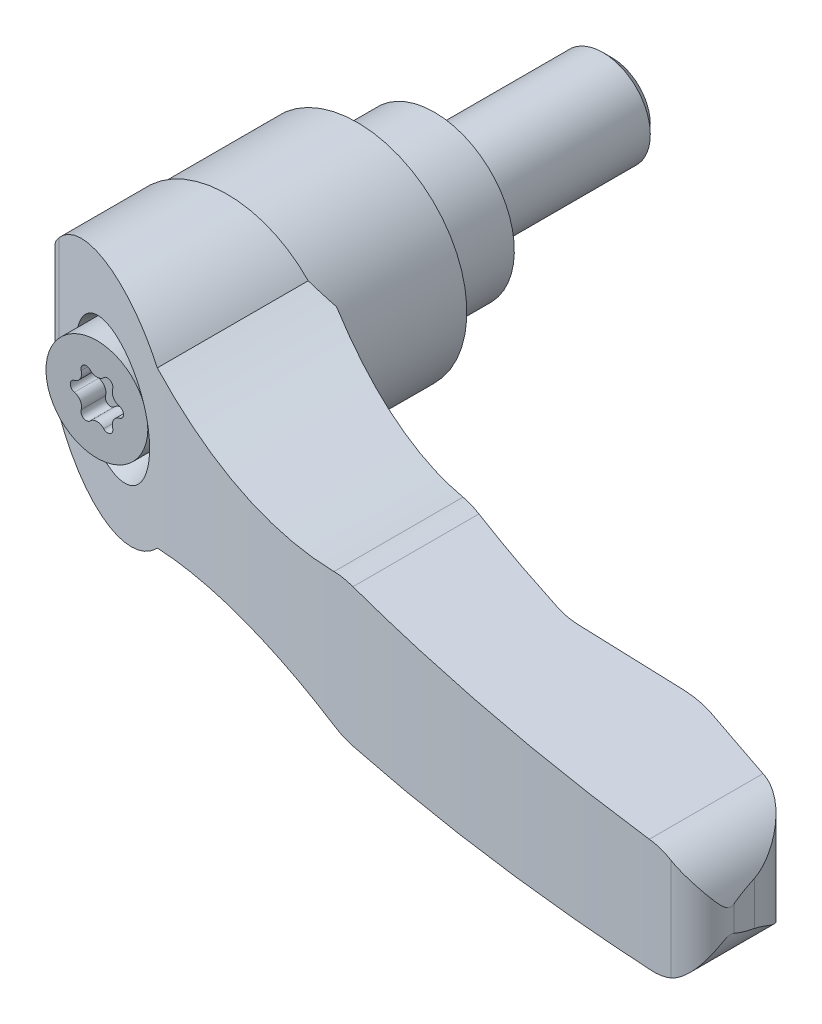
ISO-10303-21;
HEADER;
FILE_DESCRIPTION(('STEP AP214'),'2;1');
FILE_NAME('part.step','',(''),(''),'','','');
FILE_SCHEMA(('AUTOMOTIVE_DESIGN { 1 0 10303 214 1 1 1 1 }'));
ENDSEC;
DATA;
#1=APPLICATION_CONTEXT('core data for automotive mechanical design processes');
#2=APPLICATION_PROTOCOL_DEFINITION('international standard','automotive_design',2000,#1);
#3=PRODUCT_CONTEXT('',#1,'mechanical');
#4=PRODUCT('Part','Part','',(#3));
#5=PRODUCT_RELATED_PRODUCT_CATEGORY('part','',(#4));
#6=PRODUCT_DEFINITION_FORMATION('','',#4);
#7=PRODUCT_DEFINITION_CONTEXT('part definition',#1,'design');
#8=PRODUCT_DEFINITION('design','',#6,#7);
#9=PRODUCT_DEFINITION_SHAPE('','',#8);
#10=(LENGTH_UNIT() NAMED_UNIT(*) SI_UNIT(.MILLI.,.METRE.));
#11=(NAMED_UNIT(*) PLANE_ANGLE_UNIT() SI_UNIT($,.RADIAN.));
#12=(NAMED_UNIT(*) SI_UNIT($,.STERADIAN.) SOLID_ANGLE_UNIT());
#13=UNCERTAINTY_MEASURE_WITH_UNIT(LENGTH_MEASURE(1.E-05),#10,'distance_accuracy_value','');
#14=(GEOMETRIC_REPRESENTATION_CONTEXT(3) GLOBAL_UNCERTAINTY_ASSIGNED_CONTEXT((#13)) GLOBAL_UNIT_ASSIGNED_CONTEXT((#10,
#11,#12)) REPRESENTATION_CONTEXT('',''));
#15=CARTESIAN_POINT('',(0.,0.,0.));
#16=DIRECTION('',(0.,0.,1.));
#17=DIRECTION('',(1.,0.,0.));
#18=AXIS2_PLACEMENT_3D('',#15,#16,#17);
#19=CARTESIAN_POINT('',(1.616040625,0.,-15.));
#20=DIRECTION('',(0.,0.,-1.));
#21=DIRECTION('',(0.,1.,0.));
#22=AXIS2_PLACEMENT_3D('',#19,#20,#21);
#23=PLANE('',#22);
#24=CARTESIAN_POINT('',(0.,0.,-14.9999999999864));
#25=DIRECTION('',(0.,0.,1.));
#26=DIRECTION('',(0.,-1.,0.));
#27=AXIS2_PLACEMENT_3D('',#24,#25,#26);
#28=CIRCLE('',#27,3.23208125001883);
#29=CARTESIAN_POINT('',(0.,-3.23208125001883,-14.9999999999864));
#30=VERTEX_POINT('',#29);
#31=EDGE_CURVE('E617',#30,#30,#28,.T.);
#32=ORIENTED_EDGE('',*,*,#31,.F.);
#33=EDGE_LOOP('',(#32));
#34=FACE_BOUND('',#33,.T.);
#35=ADVANCED_FACE('F14',(#34),#23,.T.);
#36=CARTESIAN_POINT('',(0.,0.,-14.2320812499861));
#37=DIRECTION('',(0.,0.,1.));
#38=DIRECTION('',(0.,-1.,0.));
#39=AXIS2_PLACEMENT_3D('',#36,#37,#38);
#40=CONICAL_SURFACE('',#39,3.99999999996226,0.785398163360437);
#41=CARTESIAN_POINT('',(0.,0.,-14.23208125));
#42=DIRECTION('',(0.,0.,-1.));
#43=DIRECTION('',(0.,1.,0.));
#44=AXIS2_PLACEMENT_3D('',#41,#42,#43);
#45=CIRCLE('',#44,4.);
#46=CARTESIAN_POINT('',(0.,4.,-14.23208125));
#47=VERTEX_POINT('',#46);
#48=EDGE_CURVE('E547',#47,#47,#45,.F.);
#49=ORIENTED_EDGE('',*,*,#48,.F.);
#50=EDGE_LOOP('',(#49));
#51=FACE_BOUND('',#50,.T.);
#52=ORIENTED_EDGE('',*,*,#31,.T.);
#53=EDGE_LOOP('',(#52));
#54=FACE_BOUND('',#53,.T.);
#55=ADVANCED_FACE('F995',(#51,#54),#40,.T.);
#56=CARTESIAN_POINT('',(0.,0.,-7.116040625));
#57=DIRECTION('',(0.,0.,-1.));
#58=DIRECTION('',(0.,1.,0.));
#59=AXIS2_PLACEMENT_3D('',#56,#57,#58);
#60=CYLINDRICAL_SURFACE('',#59,4.);
#61=CARTESIAN_POINT('',(0.,0.,0.));
#62=DIRECTION('',(0.,0.,-1.));
#63=DIRECTION('',(0.,1.,0.));
#64=AXIS2_PLACEMENT_3D('',#61,#62,#63);
#65=CIRCLE('',#64,4.);
#66=CARTESIAN_POINT('',(0.,4.,0.));
#67=VERTEX_POINT('',#66);
#68=EDGE_CURVE('E543',#67,#67,#65,.F.);
#69=ORIENTED_EDGE('',*,*,#68,.F.);
#70=EDGE_LOOP('',(#69));
#71=FACE_BOUND('',#70,.T.);
#72=ORIENTED_EDGE('',*,*,#48,.T.);
#73=EDGE_LOOP('',(#72));
#74=FACE_BOUND('',#73,.T.);
#75=ADVANCED_FACE('F984',(#71,#74),#60,.T.);
#76=CARTESIAN_POINT('',(5.375,0.,0.));
#77=DIRECTION('',(0.,0.,-1.));
#78=DIRECTION('',(0.,1.,0.));
#79=AXIS2_PLACEMENT_3D('',#76,#77,#78);
#80=PLANE('',#79);
#81=ORIENTED_EDGE('',*,*,#68,.T.);
#82=EDGE_LOOP('',(#81));
#83=FACE_BOUND('',#82,.T.);
#84=CARTESIAN_POINT('',(0.,0.,0.));
#85=DIRECTION('',(0.,0.,-1.));
#86=DIRECTION('',(0.,1.,0.));
#87=AXIS2_PLACEMENT_3D('',#84,#85,#86);
#88=CIRCLE('',#87,6.75);
#89=CARTESIAN_POINT('',(0.,6.75,0.));
#90=VERTEX_POINT('',#89);
#91=EDGE_CURVE('E636',#90,#90,#88,.F.);
#92=ORIENTED_EDGE('',*,*,#91,.F.);
#93=EDGE_LOOP('',(#92));
#94=FACE_BOUND('',#93,.T.);
#95=ADVANCED_FACE('F973',(#83,#94),#80,.T.);
#96=CARTESIAN_POINT('',(0.,0.,8.25));
#97=DIRECTION('',(0.,0.,-1.));
#98=DIRECTION('',(0.,1.,0.));
#99=AXIS2_PLACEMENT_3D('',#96,#97,#98);
#100=CYLINDRICAL_SURFACE('',#99,6.75);
#101=ORIENTED_EDGE('',*,*,#91,.T.);
#102=EDGE_LOOP('',(#101));
#103=FACE_BOUND('',#102,.T.);
#104=CARTESIAN_POINT('',(0.,0.,7.15000000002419));
#105=DIRECTION('',(0.,0.,-1.));
#106=DIRECTION('',(1.,0.,0.));
#107=AXIS2_PLACEMENT_3D('',#104,#105,#106);
#108=CIRCLE('',#107,6.74999999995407);
#109=CARTESIAN_POINT('',(6.74999999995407,0.,7.15000000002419));
#110=VERTEX_POINT('',#109);
#111=EDGE_CURVE('E536',#110,#110,#108,.T.);
#112=ORIENTED_EDGE('',*,*,#111,.T.);
#113=EDGE_LOOP('',(#112));
#114=FACE_BOUND('',#113,.T.);
#115=ADVANCED_FACE('F963',(#103,#114),#100,.T.);
#116=CARTESIAN_POINT('',(0.,0.,6.9000000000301));
#117=DIRECTION('',(0.,0.,-1.));
#118=DIRECTION('',(0.,1.,0.));
#119=AXIS2_PLACEMENT_3D('',#116,#117,#118);
#120=CONICAL_SURFACE('',#119,7.000000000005,0.785398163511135);
#121=ORIENTED_EDGE('',*,*,#111,.F.);
#122=EDGE_LOOP('',(#121));
#123=FACE_BOUND('',#122,.T.);
#124=CARTESIAN_POINT('',(0.,0.,6.9));
#125=DIRECTION('',(0.,0.,-1.));
#126=DIRECTION('',(0.,1.,0.));
#127=AXIS2_PLACEMENT_3D('',#124,#125,#126);
#128=CIRCLE('',#127,7.);
#129=CARTESIAN_POINT('',(0.,7.,6.9));
#130=VERTEX_POINT('',#129);
#131=EDGE_CURVE('E532',#130,#130,#128,.T.);
#132=ORIENTED_EDGE('',*,*,#131,.T.);
#133=EDGE_LOOP('',(#132));
#134=FACE_BOUND('',#133,.T.);
#135=ADVANCED_FACE('F953',(#123,#134),#120,.F.);
#136=CARTESIAN_POINT('',(0.,0.,6.2));
#137=DIRECTION('',(0.,0.,-1.));
#138=DIRECTION('',(0.,1.,0.));
#139=AXIS2_PLACEMENT_3D('',#136,#137,#138);
#140=CYLINDRICAL_SURFACE('',#139,7.);
#141=ORIENTED_EDGE('',*,*,#131,.F.);
#142=EDGE_LOOP('',(#141));
#143=FACE_BOUND('',#142,.T.);
#144=CARTESIAN_POINT('',(0.,0.,6.5));
#145=DIRECTION('',(0.,0.,-1.));
#146=DIRECTION('',(0.,1.,0.));
#147=AXIS2_PLACEMENT_3D('',#144,#145,#146);
#148=CIRCLE('',#147,7.);
#149=CARTESIAN_POINT('',(0.,7.,6.5));
#150=VERTEX_POINT('',#149);
#151=EDGE_CURVE('E535',#150,#150,#148,.F.);
#152=ORIENTED_EDGE('',*,*,#151,.F.);
#153=EDGE_LOOP('',(#152));
#154=FACE_BOUND('',#153,.T.);
#155=ADVANCED_FACE('F943',(#143,#154),#140,.F.);
#156=CARTESIAN_POINT('',(-9.01003775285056,-19.,6.5));
#157=DIRECTION('',(0.707106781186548,0.,0.707106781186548));
#158=DIRECTION('',(-0.707106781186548,0.,0.707106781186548));
#159=AXIS2_PLACEMENT_3D('',#156,#157,#158);
#160=PLANE('',#159);
#161=DIRECTION('',(0.,1.,0.));
#162=VECTOR('',#161,1.);
#163=CARTESIAN_POINT('',(-9.01003775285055,0.,6.5));
#164=LINE('',#163,#162);
#165=CARTESIAN_POINT('',(-9.01003775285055,-2.13584185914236,6.5));
#166=VERTEX_POINT('',#165);
#167=CARTESIAN_POINT('',(-9.01003775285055,2.13584185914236,6.5));
#168=VERTEX_POINT('',#167);
#169=EDGE_CURVE('E643',#166,#168,#164,.T.);
#170=ORIENTED_EDGE('',*,*,#169,.F.);
#171=CARTESIAN_POINT('',(-0.00999999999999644,0.,-2.50003775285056));
#172=DIRECTION('',(0.707106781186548,0.,0.707106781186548));
#173=DIRECTION('',(-0.707106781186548,0.,0.707106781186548));
#174=AXIS2_PLACEMENT_3D('',#171,#172,#173);
#175=ELLIPSE('',#174,13.0814754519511,9.25);
#176=EDGE_CURVE('E644',#168,#166,#175,.T.);
#177=ORIENTED_EDGE('',*,*,#176,.F.);
#178=EDGE_LOOP('',(#170,#177));
#179=FACE_BOUND('',#178,.T.);
#180=ADVANCED_FACE('F777',(#179),#160,.F.);
#181=CARTESIAN_POINT('',(-4.635,0.,6.5));
#182=DIRECTION('',(0.,0.,-1.));
#183=DIRECTION('',(0.,1.,0.));
#184=AXIS2_PLACEMENT_3D('',#181,#182,#183);
#185=PLANE('',#184);
#186=ORIENTED_EDGE('',*,*,#169,.T.);
#187=CARTESIAN_POINT('',(-0.00999999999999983,0.,6.5));
#188=DIRECTION('',(0.,0.,1.));
#189=DIRECTION('',(-1.,0.,0.));
#190=AXIS2_PLACEMENT_3D('',#187,#188,#189);
#191=CIRCLE('',#190,9.25);
#192=EDGE_CURVE('E647',#166,#168,#191,.T.);
#193=ORIENTED_EDGE('',*,*,#192,.F.);
#194=EDGE_LOOP('',(#186,#193));
#195=FACE_BOUND('',#194,.T.);
#196=ORIENTED_EDGE('',*,*,#151,.T.);
#197=EDGE_LOOP('',(#196));
#198=FACE_BOUND('',#197,.T.);
#199=ADVANCED_FACE('F770',(#195,#198),#185,.T.);
#200=CARTESIAN_POINT('',(-0.0100000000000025,0.,13.5625));
#201=DIRECTION('',(0.,0.,1.));
#202=DIRECTION('',(-1.,0.,0.));
#203=AXIS2_PLACEMENT_3D('',#200,#201,#202);
#204=CYLINDRICAL_SURFACE('',#203,9.25);
#205=ORIENTED_EDGE('',*,*,#192,.T.);
#206=ORIENTED_EDGE('',*,*,#176,.T.);
#207=EDGE_LOOP('',(#205,#206));
#208=FACE_BOUND('',#207,.T.);
#209=CARTESIAN_POINT('',(-0.010000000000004,0.,17.5));
#210=DIRECTION('',(0.,0.,1.));
#211=DIRECTION('',(-1.,0.,0.));
#212=AXIS2_PLACEMENT_3D('',#209,#210,#211);
#213=CIRCLE('',#212,9.25);
#214=CARTESIAN_POINT('',(-9.26,0.,17.5));
#215=VERTEX_POINT('',#214);
#216=CARTESIAN_POINT('',(9.23999999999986,0.,17.5000000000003));
#217=VERTEX_POINT('',#216);
#218=EDGE_CURVE('E651',#215,#217,#213,.T.);
#219=ORIENTED_EDGE('',*,*,#218,.F.);
#220=CARTESIAN_POINT('',(-0.010000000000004,0.,17.5));
#221=DIRECTION('',(0.,0.,1.));
#222=DIRECTION('',(-1.,0.,0.));
#223=AXIS2_PLACEMENT_3D('',#220,#221,#222);
#224=CIRCLE('',#223,9.25);
#225=EDGE_CURVE('E527',#217,#215,#224,.T.);
#226=ORIENTED_EDGE('',*,*,#225,.F.);
#227=EDGE_LOOP('',(#219,#226));
#228=FACE_BOUND('',#227,.T.);
#229=ADVANCED_FACE('F768',(#208,#228),#204,.T.);
#230=CARTESIAN_POINT('',(64.6274051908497,-10.5,37.5817950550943));
#231=DIRECTION('',(0.992331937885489,0.,-0.123601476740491));
#232=DIRECTION('',(0.123601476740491,0.,0.992331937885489));
#233=AXIS2_PLACEMENT_3D('',#230,#231,#232);
#234=PLANE('',#233);
#235=CARTESIAN_POINT('',(60.25,0.,2.43788666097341));
#236=DIRECTION('',(0.992331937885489,0.,-0.123601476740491));
#237=DIRECTION('',(0.123601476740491,0.,0.992331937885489));
#238=AXIS2_PLACEMENT_3D('',#235,#236,#237);
#239=ELLIPSE('',#238,38.4299615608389,4.75);
#240=CARTESIAN_POINT('',(64.8745408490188,1.08449155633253,39.5659186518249));
#241=VERTEX_POINT('',#240);
#242=CARTESIAN_POINT('',(64.6274051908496,1.84413226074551,37.5817950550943));
#243=VERTEX_POINT('',#242);
#244=EDGE_CURVE('E417',#241,#243,#239,.F.);
#245=ORIENTED_EDGE('',*,*,#244,.F.);
#246=DIRECTION('',(0.,-1.,0.));
#247=VECTOR('',#246,1.);
#248=CARTESIAN_POINT('',(64.8745408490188,-10.5,39.5659186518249));
#249=LINE('',#248,#247);
#250=CARTESIAN_POINT('',(64.8745408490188,-1.08449155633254,39.5659186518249));
#251=VERTEX_POINT('',#250);
#252=EDGE_CURVE('E456',#251,#241,#249,.F.);
#253=ORIENTED_EDGE('',*,*,#252,.F.);
#254=CARTESIAN_POINT('',(60.25,0.,2.43788666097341));
#255=DIRECTION('',(0.992331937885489,0.,-0.123601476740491));
#256=DIRECTION('',(0.123601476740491,0.,0.992331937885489));
#257=AXIS2_PLACEMENT_3D('',#254,#255,#256);
#258=ELLIPSE('',#257,38.4299615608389,4.75);
#259=CARTESIAN_POINT('',(64.6274051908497,-1.84413226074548,37.5817950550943));
#260=VERTEX_POINT('',#259);
#261=EDGE_CURVE('E440',#260,#251,#258,.F.);
#262=ORIENTED_EDGE('',*,*,#261,.F.);
#263=DIRECTION('',(0.,-1.,0.));
#264=VECTOR('',#263,1.);
#265=CARTESIAN_POINT('',(64.6274051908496,-10.5,37.5817950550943));
#266=LINE('',#265,#264);
#267=EDGE_CURVE('E650',#243,#260,#266,.T.);
#268=ORIENTED_EDGE('',*,*,#267,.F.);
#269=EDGE_LOOP('',(#245,#253,#262,#268));
#270=FACE_BOUND('',#269,.T.);
#271=ADVANCED_FACE('F426',(#270),#234,.T.);
#272=CARTESIAN_POINT('',(58.6337202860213,-10.5,38.3283479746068));
#273=DIRECTION('',(0.,-1.,0.));
#274=DIRECTION('',(1.,0.,0.));
#275=AXIS2_PLACEMENT_3D('',#272,#273,#274);
#276=CYLINDRICAL_SURFACE('',#275,6.04);
#277=CARTESIAN_POINT('',(64.6274051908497,1.84413226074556,37.5817950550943));
#278=CARTESIAN_POINT('',(64.6175868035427,1.86745330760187,37.5030045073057));
#279=CARTESIAN_POINT('',(64.6063375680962,1.89362327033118,37.4253204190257));
#280=CARTESIAN_POINT('',(64.5811702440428,1.95049016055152,37.2721928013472));
#281=CARTESIAN_POINT('',(64.5672561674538,1.98118026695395,37.1967460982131));
#282=CARTESIAN_POINT('',(64.5369883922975,2.04585034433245,37.0482136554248));
#283=CARTESIAN_POINT('',(64.520645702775,2.07981523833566,36.9751189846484));
#284=CARTESIAN_POINT('',(64.4855821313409,2.15032519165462,36.8307396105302));
#285=CARTESIAN_POINT('',(64.4668602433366,2.18687133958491,36.7594556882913));
#286=CARTESIAN_POINT('',(64.4072221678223,2.29938724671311,36.547961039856));
#287=CARTESIAN_POINT('',(64.3628565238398,2.37818379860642,36.410218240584));
#288=CARTESIAN_POINT('',(64.2652007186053,2.53960895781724,36.1400450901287));
#289=CARTESIAN_POINT('',(64.2118976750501,2.6222429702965,36.007622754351));
#290=CARTESIAN_POINT('',(64.077119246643,2.81672317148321,35.7040219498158));
#291=CARTESIAN_POINT('',(63.9921849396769,2.92909268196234,35.5347005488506));
#292=CARTESIAN_POINT('',(63.8063278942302,3.15216626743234,35.2039790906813));
#293=CARTESIAN_POINT('',(63.7054078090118,3.26287061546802,35.0425777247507));
#294=CARTESIAN_POINT('',(63.4870671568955,3.47959027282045,34.7278934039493));
#295=CARTESIAN_POINT('',(63.369645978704,3.58560540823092,34.5746107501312));
#296=CARTESIAN_POINT('',(63.1179209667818,3.78996521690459,34.277236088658));
#297=CARTESIAN_POINT('',(62.9836257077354,3.88831374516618,34.1331394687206));
#298=CARTESIAN_POINT('',(62.6561598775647,4.10136712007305,33.815313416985));
#299=CARTESIAN_POINT('',(62.4571888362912,4.21258905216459,33.6450495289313));
#300=CARTESIAN_POINT('',(62.1378586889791,4.36029911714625,33.4069452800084));
#301=CARTESIAN_POINT('',(62.0281124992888,4.40629516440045,33.3305585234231));
#302=CARTESIAN_POINT('',(61.8018114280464,4.49098569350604,33.1841350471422));
#303=CARTESIAN_POINT('',(61.6852609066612,4.52968478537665,33.1140943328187));
#304=CARTESIAN_POINT('',(61.4786111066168,4.58924867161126,32.9993621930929));
#305=CARTESIAN_POINT('',(61.3900115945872,4.61209493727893,32.9529824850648));
#306=CARTESIAN_POINT('',(61.2097340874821,4.65295056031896,32.8642982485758));
#307=CARTESIAN_POINT('',(61.1180570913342,4.67096147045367,32.82199241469));
#308=CARTESIAN_POINT('',(60.9313596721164,4.70183469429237,32.7415027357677));
#309=CARTESIAN_POINT('',(60.8363219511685,4.71466416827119,32.7033462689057));
#310=CARTESIAN_POINT('',(60.6438287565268,4.73463763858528,32.631712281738));
#311=CARTESIAN_POINT('',(60.5463713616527,4.74177695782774,32.5982386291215));
#312=CARTESIAN_POINT('',(60.4479724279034,4.74587261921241,32.5672639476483));
#313=B_SPLINE_CURVE_WITH_KNOTS('',3,(#277,#278,#279,#280,#281,#282,#283,#284,#285,#286,#287,
#288,#289,#290,#291,#292,#293,#294,#295,#296,#297,#298,#299,#300,#301,#302,#303,#304,#305,#306,
#307,#308,#309,#310,#311,#312),.UNSPECIFIED.,.F.,.F.,(4,2,2,2,2,2,2,2,2,2,2,2,2,2,2,2,2,4),(0.,
0.248076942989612,0.495783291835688,0.742399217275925,0.989119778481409,1.48293160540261,
1.97746142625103,2.63745339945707,3.29733594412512,3.95724294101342,4.61681594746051,
5.46693586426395,5.89075482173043,6.31430511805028,6.62183365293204,6.92926331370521,
7.23861197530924,7.54821464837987),.UNSPECIFIED.);
#314=CARTESIAN_POINT('',(60.4479724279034,4.74587261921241,32.5672639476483));
#315=VERTEX_POINT('',#314);
#316=EDGE_CURVE('E408',#243,#315,#313,.T.);
#317=ORIENTED_EDGE('',*,*,#316,.F.);
#318=ORIENTED_EDGE('',*,*,#267,.T.);
#319=CARTESIAN_POINT('',(60.4479724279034,-4.74587261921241,32.5672639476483));
#320=CARTESIAN_POINT('',(60.5755504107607,-4.74057354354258,32.6074069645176));
#321=CARTESIAN_POINT('',(60.7015088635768,-4.73014540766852,32.6517620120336));
#322=CARTESIAN_POINT('',(60.9490652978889,-4.69992242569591,32.7481786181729));
#323=CARTESIAN_POINT('',(61.0706698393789,-4.6801423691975,32.8002279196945));
#324=CARTESIAN_POINT('',(61.3074659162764,-4.63235500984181,32.9108206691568));
#325=CARTESIAN_POINT('',(61.4227141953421,-4.60444273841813,32.9692844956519));
#326=CARTESIAN_POINT('',(61.6477173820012,-4.54120548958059,33.0925213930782));
#327=CARTESIAN_POINT('',(61.7574696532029,-4.50587699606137,33.1572974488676));
#328=CARTESIAN_POINT('',(61.9940137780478,-4.42040174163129,33.307032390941));
#329=CARTESIAN_POINT('',(62.1193938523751,-4.36870213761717,33.3933358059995));
#330=CARTESIAN_POINT('',(62.3610721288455,-4.25718277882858,33.5732278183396));
#331=CARTESIAN_POINT('',(62.4773638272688,-4.19735729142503,33.6668215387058));
#332=CARTESIAN_POINT('',(62.7012840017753,-4.07066877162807,33.8608437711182));
#333=CARTESIAN_POINT('',(62.8088611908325,-4.0037687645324,33.9613071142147));
#334=CARTESIAN_POINT('',(63.0146476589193,-3.86453813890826,34.1677809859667));
#335=CARTESIAN_POINT('',(63.1128596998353,-3.79220913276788,34.2737898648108));
#336=CARTESIAN_POINT('',(63.3331746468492,-3.61700510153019,34.5290929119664));
#337=CARTESIAN_POINT('',(63.4514763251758,-3.51235864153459,34.6804594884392));
#338=CARTESIAN_POINT('',(63.6718053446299,-3.29808480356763,34.9913387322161));
#339=CARTESIAN_POINT('',(63.7738256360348,-3.18845529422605,35.1508548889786));
#340=CARTESIAN_POINT('',(63.961662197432,-2.9676568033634,35.4770445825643));
#341=CARTESIAN_POINT('',(64.0475378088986,-2.85649513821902,35.6436890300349));
#342=CARTESIAN_POINT('',(64.2038484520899,-2.63586419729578,35.9851508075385));
#343=CARTESIAN_POINT('',(64.2742871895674,-2.52639452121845,36.1599661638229));
#344=CARTESIAN_POINT('',(64.3705847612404,-2.36382517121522,36.4361542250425));
#345=CARTESIAN_POINT('',(64.4019853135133,-2.30809068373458,36.5340606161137));
#346=CARTESIAN_POINT('',(64.4601539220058,-2.20019362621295,36.7330390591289));
#347=CARTESIAN_POINT('',(64.4869269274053,-2.14802727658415,36.8341075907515));
#348=CARTESIAN_POINT('',(64.5357331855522,-2.04890785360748,37.0402846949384));
#349=CARTESIAN_POINT('',(64.5577546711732,-2.00196785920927,37.1454025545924));
#350=CARTESIAN_POINT('',(64.596614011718,-1.91618262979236,37.360168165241));
#351=CARTESIAN_POINT('',(64.6134353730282,-1.87736327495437,37.4698291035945));
#352=CARTESIAN_POINT('',(64.6274051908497,-1.84413226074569,37.5817950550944));
#353=B_SPLINE_CURVE_WITH_KNOTS('',3,(#319,#320,#321,#322,#323,#324,#325,#326,#327,#328,#329,
#330,#331,#332,#333,#334,#335,#336,#337,#338,#339,#340,#341,#342,#343,#344,#345,#346,#347,#348,
#349,#350,#351,#352),.UNSPECIFIED.,.F.,.F.,(4,2,2,2,2,2,2,2,2,2,2,2,2,2,2,2,4),(0.,
0.401264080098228,0.801895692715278,1.19802151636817,1.59433557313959,2.0758833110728,
2.55777255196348,3.04231807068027,3.52672024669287,4.18208013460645,4.83772302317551,
5.49090678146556,6.1439335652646,6.49464389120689,6.84497677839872,7.19616755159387,
7.54846105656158),.UNSPECIFIED.);
#354=CARTESIAN_POINT('',(60.4479724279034,-4.74587261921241,32.5672639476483));
#355=VERTEX_POINT('',#354);
#356=EDGE_CURVE('E432',#355,#260,#353,.T.);
#357=ORIENTED_EDGE('',*,*,#356,.F.);
#358=DIRECTION('',(0.,-1.,0.));
#359=VECTOR('',#358,1.);
#360=CARTESIAN_POINT('',(60.4479724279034,-10.5,32.5672639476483));
#361=LINE('',#360,#359);
#362=EDGE_CURVE('E522',#315,#355,#361,.T.);
#363=ORIENTED_EDGE('',*,*,#362,.F.);
#364=EDGE_LOOP('',(#317,#318,#357,#363));
#365=FACE_BOUND('',#364,.T.);
#366=ADVANCED_FACE('F420',(#365),#276,.T.);
#367=CARTESIAN_POINT('',(-9.26,-10.5,17.5));
#368=DIRECTION('',(0.,0.,-1.));
#369=DIRECTION('',(0.,1.,0.));
#370=AXIS2_PLACEMENT_3D('',#367,#368,#369);
#371=PLANE('',#370);
#372=DIRECTION('',(0.,-1.,0.));
#373=VECTOR('',#372,1.);
#374=CARTESIAN_POINT('',(-9.26,-10.5,17.5));
#375=LINE('',#374,#373);
#376=CARTESIAN_POINT('',(-9.26,2.12188595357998,17.5));
#377=VERTEX_POINT('',#376);
#378=EDGE_CURVE('E523',#377,#215,#375,.T.);
#379=ORIENTED_EDGE('',*,*,#378,.F.);
#380=CARTESIAN_POINT('',(0.,0.,17.5));
#381=DIRECTION('',(0.,0.,1.));
#382=DIRECTION('',(0.,-1.,0.));
#383=AXIS2_PLACEMENT_3D('',#380,#381,#382);
#384=CIRCLE('',#383,9.5);
#385=CARTESIAN_POINT('',(6.84374087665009,6.58887022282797,17.5));
#386=VERTEX_POINT('',#385);
#387=EDGE_CURVE('E334',#386,#377,#384,.T.);
#388=ORIENTED_EDGE('',*,*,#387,.F.);
#389=CARTESIAN_POINT('',(19.25,44.09,17.5));
#390=DIRECTION('',(0.,0.,1.));
#391=DIRECTION('',(0.,-1.,0.));
#392=AXIS2_PLACEMENT_3D('',#389,#390,#391);
#393=CIRCLE('',#392,39.5);
#394=CARTESIAN_POINT('',(9.23999999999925,5.87940068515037,17.5000000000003));
#395=VERTEX_POINT('',#394);
#396=EDGE_CURVE('E335',#386,#395,#393,.T.);
#397=ORIENTED_EDGE('',*,*,#396,.T.);
#398=DIRECTION('',(0.,-1.,0.));
#399=VECTOR('',#398,1.);
#400=CARTESIAN_POINT('',(9.23999999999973,-10.5,17.5000000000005));
#401=LINE('',#400,#399);
#402=EDGE_CURVE('E467',#395,#217,#401,.T.);
#403=ORIENTED_EDGE('',*,*,#402,.T.);
#404=ORIENTED_EDGE('',*,*,#225,.T.);
#405=EDGE_LOOP('',(#379,#388,#397,#403,#404));
#406=FACE_BOUND('',#405,.T.);
#407=ADVANCED_FACE('F425',(#406),#371,.T.);
#408=CARTESIAN_POINT('',(-9.26,-10.5,21.2038249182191));
#409=DIRECTION('',(-1.,0.,0.));
#410=DIRECTION('',(0.,-1.,0.));
#411=AXIS2_PLACEMENT_3D('',#408,#409,#410);
#412=PLANE('',#411);
#413=ORIENTED_EDGE('',*,*,#378,.T.);
#414=DIRECTION('',(0.,1.,0.));
#415=VECTOR('',#414,1.);
#416=CARTESIAN_POINT('',(-9.26,-10.5,17.5));
#417=LINE('',#416,#415);
#418=CARTESIAN_POINT('',(-9.26,-2.12188595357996,17.5));
#419=VERTEX_POINT('',#418);
#420=EDGE_CURVE('E653',#419,#215,#417,.T.);
#421=ORIENTED_EDGE('',*,*,#420,.F.);
#422=DIRECTION('',(0.,0.,1.));
#423=VECTOR('',#422,1.);
#424=CARTESIAN_POINT('',(-9.26,-2.12188595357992,42.5));
#425=LINE('',#424,#423);
#426=CARTESIAN_POINT('',(-9.26,-2.12188595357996,21.2038249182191));
#427=VERTEX_POINT('',#426);
#428=EDGE_CURVE('E526',#427,#419,#425,.F.);
#429=ORIENTED_EDGE('',*,*,#428,.F.);
#430=DIRECTION('',(0.,-1.,0.));
#431=VECTOR('',#430,1.);
#432=CARTESIAN_POINT('',(-9.26,-10.5,21.2038249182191));
#433=LINE('',#432,#431);
#434=CARTESIAN_POINT('',(-9.26,2.12188595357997,21.2038249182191));
#435=VERTEX_POINT('',#434);
#436=EDGE_CURVE('E489',#435,#427,#433,.T.);
#437=ORIENTED_EDGE('',*,*,#436,.F.);
#438=DIRECTION('',(0.,0.,1.));
#439=VECTOR('',#438,1.);
#440=CARTESIAN_POINT('',(-9.26,2.12188595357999,42.5));
#441=LINE('',#440,#439);
#442=EDGE_CURVE('E487',#377,#435,#441,.T.);
#443=ORIENTED_EDGE('',*,*,#442,.F.);
#444=EDGE_LOOP('',(#413,#421,#429,#437,#443));
#445=FACE_BOUND('',#444,.T.);
#446=ADVANCED_FACE('F766',(#445),#412,.T.);
#447=CARTESIAN_POINT('',(-9.26,-10.5,17.5));
#448=DIRECTION('',(0.,0.,-1.));
#449=DIRECTION('',(0.,1.,0.));
#450=AXIS2_PLACEMENT_3D('',#447,#448,#449);
#451=PLANE('',#450);
#452=DIRECTION('',(0.,-1.,0.));
#453=VECTOR('',#452,1.);
#454=CARTESIAN_POINT('',(9.23999999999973,-10.5,17.5000000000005));
#455=LINE('',#454,#453);
#456=CARTESIAN_POINT('',(9.23999999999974,-5.87940068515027,17.5000000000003));
#457=VERTEX_POINT('',#456);
#458=EDGE_CURVE('E665',#217,#457,#455,.T.);
#459=ORIENTED_EDGE('',*,*,#458,.T.);
#460=CARTESIAN_POINT('',(19.25,-44.09,17.5));
#461=DIRECTION('',(0.,0.,1.));
#462=DIRECTION('',(0.,-1.,0.));
#463=AXIS2_PLACEMENT_3D('',#460,#461,#462);
#464=CIRCLE('',#463,39.5);
#465=CARTESIAN_POINT('',(6.84374087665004,-6.588870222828,17.5));
#466=VERTEX_POINT('',#465);
#467=EDGE_CURVE('E301',#457,#466,#464,.T.);
#468=ORIENTED_EDGE('',*,*,#467,.T.);
#469=CARTESIAN_POINT('',(0.,0.,17.5));
#470=DIRECTION('',(0.,0.,1.));
#471=DIRECTION('',(0.,-1.,0.));
#472=AXIS2_PLACEMENT_3D('',#469,#470,#471);
#473=CIRCLE('',#472,9.5);
#474=EDGE_CURVE('E492',#419,#466,#473,.T.);
#475=ORIENTED_EDGE('',*,*,#474,.F.);
#476=ORIENTED_EDGE('',*,*,#420,.T.);
#477=ORIENTED_EDGE('',*,*,#218,.T.);
#478=EDGE_LOOP('',(#459,#468,#475,#476,#477));
#479=FACE_BOUND('',#478,.T.);
#480=ADVANCED_FACE('F764',(#479),#451,.T.);
#481=CARTESIAN_POINT('',(53.8294507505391,-10.5,30.4829917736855));
#482=DIRECTION('',(0.300372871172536,0.,-0.95382185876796));
#483=DIRECTION('',(0.95382185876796,0.,0.300372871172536));
#484=AXIS2_PLACEMENT_3D('',#481,#482,#483);
#485=PLANE('',#484);
#486=CARTESIAN_POINT('',(60.25,0.,32.5049194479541));
#487=DIRECTION('',(0.300372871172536,0.,-0.95382185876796));
#488=DIRECTION('',(0.95382185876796,0.,0.300372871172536));
#489=AXIS2_PLACEMENT_3D('',#486,#487,#488);
#490=ELLIPSE('',#489,4.97996555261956,4.75);
#491=CARTESIAN_POINT('',(60.25,4.75,32.5049194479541));
#492=VERTEX_POINT('',#491);
#493=EDGE_CURVE('E457',#315,#492,#490,.F.);
#494=ORIENTED_EDGE('',*,*,#493,.F.);
#495=ORIENTED_EDGE('',*,*,#362,.T.);
#496=CARTESIAN_POINT('',(60.25,0.,32.5049194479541));
#497=DIRECTION('',(0.300372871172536,0.,-0.95382185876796));
#498=DIRECTION('',(0.95382185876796,0.,0.300372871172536));
#499=AXIS2_PLACEMENT_3D('',#496,#497,#498);
#500=ELLIPSE('',#499,4.97996555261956,4.75);
#501=CARTESIAN_POINT('',(60.25,-4.75,32.5049194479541));
#502=VERTEX_POINT('',#501);
#503=EDGE_CURVE('E441',#502,#355,#500,.F.);
#504=ORIENTED_EDGE('',*,*,#503,.F.);
#505=DIRECTION('',(-0.953255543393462,-0.0344545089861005,-0.300194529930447));
#506=VECTOR('',#505,1.);
#507=CARTESIAN_POINT('',(60.25,-4.75,32.5049194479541));
#508=LINE('',#507,#506);
#509=CARTESIAN_POINT('',(53.8294507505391,-4.98206460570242,30.4829917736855));
#510=VERTEX_POINT('',#509);
#511=EDGE_CURVE('E504',#502,#510,#508,.T.);
#512=ORIENTED_EDGE('',*,*,#511,.T.);
#513=DIRECTION('',(0.,-1.,0.));
#514=VECTOR('',#513,1.);
#515=CARTESIAN_POINT('',(53.8294507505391,-10.5,30.4829917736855));
#516=LINE('',#515,#514);
#517=CARTESIAN_POINT('',(53.8294507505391,4.98206460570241,30.4829917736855));
#518=VERTEX_POINT('',#517);
#519=EDGE_CURVE('E519',#518,#510,#516,.T.);
#520=ORIENTED_EDGE('',*,*,#519,.F.);
#521=DIRECTION('',(0.953255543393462,-0.0344545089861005,0.300194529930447));
#522=VECTOR('',#521,1.);
#523=CARTESIAN_POINT('',(53.8294507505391,4.98206460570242,30.4829917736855));
#524=LINE('',#523,#522);
#525=EDGE_CURVE('E469',#518,#492,#524,.T.);
#526=ORIENTED_EDGE('',*,*,#525,.T.);
#527=EDGE_LOOP('',(#494,#495,#504,#512,#520,#526));
#528=FACE_BOUND('',#527,.T.);
#529=ADVANCED_FACE('F714',(#528),#485,.T.);
#530=CARTESIAN_POINT('',(51.0780352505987,-10.5,39.22));
#531=DIRECTION('',(0.,-1.,0.));
#532=DIRECTION('',(1.,0.,0.));
#533=AXIS2_PLACEMENT_3D('',#530,#531,#532);
#534=CYLINDRICAL_SURFACE('',#533,9.15999999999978);
#535=CARTESIAN_POINT('',(51.0780352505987,5.08151188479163,39.22));
#536=DIRECTION('',(-0.0361204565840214,-0.999347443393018,0.));
#537=DIRECTION('',(0.999347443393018,-0.0361204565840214,0.));
#538=AXIS2_PLACEMENT_3D('',#535,#536,#537);
#539=ELLIPSE('',#538,9.16598132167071,9.15999999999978);
#540=CARTESIAN_POINT('',(51.0780352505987,5.08151188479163,30.06));
#541=VERTEX_POINT('',#540);
#542=EDGE_CURVE('E472',#541,#518,#539,.T.);
#543=ORIENTED_EDGE('',*,*,#542,.T.);
#544=ORIENTED_EDGE('',*,*,#519,.T.);
#545=CARTESIAN_POINT('',(51.0780352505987,-5.08151188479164,39.22));
#546=DIRECTION('',(-0.0361204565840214,0.999347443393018,0.));
#547=DIRECTION('',(-0.999347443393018,-0.0361204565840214,0.));
#548=AXIS2_PLACEMENT_3D('',#545,#546,#547);
#549=ELLIPSE('',#548,9.16598132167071,9.15999999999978);
#550=CARTESIAN_POINT('',(51.0780352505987,-5.08151188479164,30.06));
#551=VERTEX_POINT('',#550);
#552=EDGE_CURVE('E299',#510,#551,#549,.T.);
#553=ORIENTED_EDGE('',*,*,#552,.T.);
#554=DIRECTION('',(0.,1.,0.));
#555=VECTOR('',#554,1.);
#556=CARTESIAN_POINT('',(51.0780352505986,-10.5,30.06));
#557=LINE('',#556,#555);
#558=EDGE_CURVE('E516',#541,#551,#557,.F.);
#559=ORIENTED_EDGE('',*,*,#558,.F.);
#560=EDGE_LOOP('',(#543,#544,#553,#559));
#561=FACE_BOUND('',#560,.T.);
#562=ADVANCED_FACE('F716',(#561),#534,.T.);
#563=CARTESIAN_POINT('',(42.239481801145,-10.5,30.06));
#564=DIRECTION('',(0.,0.,-1.));
#565=DIRECTION('',(0.,1.,0.));
#566=AXIS2_PLACEMENT_3D('',#563,#564,#565);
#567=PLANE('',#566);
#568=DIRECTION('',(0.999347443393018,-0.0361204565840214,0.));
#569=VECTOR('',#568,1.);
#570=CARTESIAN_POINT('',(30.3472861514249,5.83080496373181,30.06));
#571=LINE('',#570,#569);
#572=CARTESIAN_POINT('',(42.239481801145,5.4009729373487,30.06));
#573=VERTEX_POINT('',#572);
#574=EDGE_CURVE('E473',#573,#541,#571,.T.);
#575=ORIENTED_EDGE('',*,*,#574,.T.);
#576=ORIENTED_EDGE('',*,*,#558,.T.);
#577=DIRECTION('',(-0.999347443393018,-0.0361204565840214,0.));
#578=VECTOR('',#577,1.);
#579=CARTESIAN_POINT('',(60.25,-4.75,30.06));
#580=LINE('',#579,#578);
#581=CARTESIAN_POINT('',(42.239481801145,-5.4009729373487,30.06));
#582=VERTEX_POINT('',#581);
#583=EDGE_CURVE('E501',#551,#582,#580,.T.);
#584=ORIENTED_EDGE('',*,*,#583,.T.);
#585=DIRECTION('',(0.,-1.,0.));
#586=VECTOR('',#585,1.);
#587=CARTESIAN_POINT('',(42.239481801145,-10.5,30.06));
#588=LINE('',#587,#586);
#589=EDGE_CURVE('E514',#582,#573,#588,.F.);
#590=ORIENTED_EDGE('',*,*,#589,.T.);
#591=EDGE_LOOP('',(#575,#576,#584,#590));
#592=FACE_BOUND('',#591,.T.);
#593=ADVANCED_FACE('F695',(#592),#567,.T.);
#594=CARTESIAN_POINT('',(42.2394818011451,-10.5,23.0799999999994));
#595=DIRECTION('',(0.,-1.,0.));
#596=DIRECTION('',(1.,0.,0.));
#597=AXIS2_PLACEMENT_3D('',#594,#595,#596);
#598=CYLINDRICAL_SURFACE('',#597,6.98000000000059);
#599=DIRECTION('',(0.,-1.,0.));
#600=VECTOR('',#599,1.);
#601=CARTESIAN_POINT('',(40.3024609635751,-10.5,29.785844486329));
#602=LINE('',#601,#600);
#603=CARTESIAN_POINT('',(40.3024609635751,-5.47098470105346,29.7858444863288));
#604=VERTEX_POINT('',#603);
#605=CARTESIAN_POINT('',(40.3024609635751,5.47098470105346,29.7858444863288));
#606=VERTEX_POINT('',#605);
#607=EDGE_CURVE('E531',#604,#606,#602,.F.);
#608=ORIENTED_EDGE('',*,*,#607,.T.);
#609=CARTESIAN_POINT('',(42.2394818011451,5.40097293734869,23.0799999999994));
#610=DIRECTION('',(-0.0361204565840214,-0.999347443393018,0.));
#611=DIRECTION('',(0.999347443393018,-0.0361204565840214,0.));
#612=AXIS2_PLACEMENT_3D('',#609,#610,#611);
#613=ELLIPSE('',#612,6.98455781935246,6.98000000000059);
#614=EDGE_CURVE('E476',#606,#573,#613,.F.);
#615=ORIENTED_EDGE('',*,*,#614,.T.);
#616=ORIENTED_EDGE('',*,*,#589,.F.);
#617=CARTESIAN_POINT('',(42.2394818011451,-5.4009729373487,23.0799999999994));
#618=DIRECTION('',(-0.0361204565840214,0.999347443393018,0.));
#619=DIRECTION('',(-0.999347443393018,-0.0361204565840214,0.));
#620=AXIS2_PLACEMENT_3D('',#617,#618,#619);
#621=ELLIPSE('',#620,6.98455781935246,6.98000000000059);
#622=EDGE_CURVE('E503',#582,#604,#621,.F.);
#623=ORIENTED_EDGE('',*,*,#622,.T.);
#624=EDGE_LOOP('',(#608,#615,#616,#623));
#625=FACE_BOUND('',#624,.T.);
#626=ADVANCED_FACE('F309',(#625),#598,.F.);
#627=CARTESIAN_POINT('',(88.9416647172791,-10.5,-138.600024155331));
#628=DIRECTION('',(0.,-1.,0.));
#629=DIRECTION('',(1.,0.,0.));
#630=AXIS2_PLACEMENT_3D('',#627,#628,#629);
#631=CYLINDRICAL_SURFACE('',#630,175.27);
#632=CARTESIAN_POINT('',(30.3472861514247,5.83080496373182,26.5855433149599));
#633=CARTESIAN_POINT('',(30.1696679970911,5.83722947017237,26.5225405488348));
#634=CARTESIAN_POINT('',(29.9919650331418,5.83772087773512,26.45918181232));
#635=CARTESIAN_POINT('',(29.6377732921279,5.82691956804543,26.3322542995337));
#636=CARTESIAN_POINT('',(29.461282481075,5.81567269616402,26.2686872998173));
#637=CARTESIAN_POINT('',(29.1095062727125,5.78152581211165,26.1413510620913));
#638=CARTESIAN_POINT('',(28.9342208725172,5.75862582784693,26.0775818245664));
#639=CARTESIAN_POINT('',(28.5848474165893,5.70116062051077,25.9498538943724));
#640=CARTESIAN_POINT('',(28.4107667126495,5.6665501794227,25.8858954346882));
#641=CARTESIAN_POINT('',(28.2379732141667,5.62616845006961,25.8220994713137));
#642=B_SPLINE_CURVE_WITH_KNOTS('',3,(#632,#633,#634,#635,#636,#637,#638,#639,#640,#641),
.UNSPECIFIED.,.F.,.F.,(4,2,2,2,4),(0.,0.565613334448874,1.1290258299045,1.69243697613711,
2.2580489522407),.UNSPECIFIED.);
#643=CARTESIAN_POINT('',(30.3472861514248,5.83080496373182,26.5855433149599));
#644=VERTEX_POINT('',#643);
#645=CARTESIAN_POINT('',(28.2379732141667,5.62616845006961,25.8220994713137));
#646=VERTEX_POINT('',#645);
#647=EDGE_CURVE('E471',#644,#646,#642,.T.);
#648=ORIENTED_EDGE('',*,*,#647,.F.);
#649=CARTESIAN_POINT('',(88.9416647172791,3.71296724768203,-138.600024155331));
#650=DIRECTION('',(-0.0361204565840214,-0.999347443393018,0.));
#651=DIRECTION('',(0.999347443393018,-0.0361204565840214,0.));
#652=AXIS2_PLACEMENT_3D('',#649,#650,#651);
#653=ELLIPSE('',#652,175.384448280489,175.27);
#654=EDGE_CURVE('E418',#644,#606,#653,.F.);
#655=ORIENTED_EDGE('',*,*,#654,.T.);
#656=ORIENTED_EDGE('',*,*,#607,.F.);
#657=CARTESIAN_POINT('',(88.9416647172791,-3.71296724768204,-138.600024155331));
#658=DIRECTION('',(-0.0361204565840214,0.999347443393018,0.));
#659=DIRECTION('',(-0.999347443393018,-0.0361204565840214,0.));
#660=AXIS2_PLACEMENT_3D('',#657,#658,#659);
#661=ELLIPSE('',#660,175.384448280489,175.27);
#662=CARTESIAN_POINT('',(30.3472861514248,-5.83080496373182,26.5855433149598));
#663=VERTEX_POINT('',#662);
#664=EDGE_CURVE('E500',#604,#663,#661,.F.);
#665=ORIENTED_EDGE('',*,*,#664,.T.);
#666=CARTESIAN_POINT('',(28.237973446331,-5.6261685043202,25.8220995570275));
#667=CARTESIAN_POINT('',(28.4107669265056,-5.66655022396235,25.8858955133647));
#668=CARTESIAN_POINT('',(28.584847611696,-5.70116065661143,25.9498539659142));
#669=CARTESIAN_POINT('',(28.9342210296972,-5.75862584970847,26.0775818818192));
#670=CARTESIAN_POINT('',(29.1095064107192,-5.78152582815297,26.1413511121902));
#671=CARTESIAN_POINT('',(29.461282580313,-5.81567270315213,26.2686873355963));
#672=CARTESIAN_POINT('',(29.6377733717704,-5.82691957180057,26.3322543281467));
#673=CARTESIAN_POINT('',(29.9919650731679,-5.83772087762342,26.4591818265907));
#674=CARTESIAN_POINT('',(30.169668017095,-5.83722946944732,26.5225405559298));
#675=CARTESIAN_POINT('',(30.3472861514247,-5.83080496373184,26.5855433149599));
#676=B_SPLINE_CURVE_WITH_KNOTS('',3,(#666,#667,#668,#669,#670,#671,#672,#673,#674,#675),
.UNSPECIFIED.,.F.,.F.,(4,2,2,2,4),(0.,0.565611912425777,1.12902299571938,1.69243542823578,
2.25804869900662),.UNSPECIFIED.);
#677=CARTESIAN_POINT('',(28.237973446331,-5.6261685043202,25.8220995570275));
#678=VERTEX_POINT('',#677);
#679=EDGE_CURVE('E289',#678,#663,#676,.T.);
#680=ORIENTED_EDGE('',*,*,#679,.F.);
#681=CARTESIAN_POINT('',(28.237973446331,-5.6261685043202,25.8220995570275));
#682=CARTESIAN_POINT('',(27.6467124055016,-5.48799745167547,25.6038196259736));
#683=CARTESIAN_POINT('',(27.0537779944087,-5.36383084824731,25.3812778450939));
#684=CARTESIAN_POINT('',(25.8659006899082,-5.14331117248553,24.9280288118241));
#685=CARTESIAN_POINT('',(25.2709579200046,-5.04695642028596,24.6973220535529));
#686=CARTESIAN_POINT('',(24.0803912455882,-4.88185687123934,24.2280988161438));
#687=CARTESIAN_POINT('',(23.4847674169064,-4.81310925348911,23.9895831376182));
#688=CARTESIAN_POINT('',(22.2940534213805,-4.70292970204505,23.5051335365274));
#689=CARTESIAN_POINT('',(21.6989632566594,-4.66149787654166,23.2591995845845));
#690=CARTESIAN_POINT('',(19.93823636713,-4.57874286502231,22.520112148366));
#691=CARTESIAN_POINT('',(18.7748149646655,-4.57591682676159,22.0168726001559));
#692=CARTESIAN_POINT('',(16.4631439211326,-4.67145944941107,20.9870607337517));
#693=CARTESIAN_POINT('',(15.3148886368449,-4.76978933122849,20.4604974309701));
#694=CARTESIAN_POINT('',(13.7610005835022,-4.97097993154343,19.7276539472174));
#695=CARTESIAN_POINT('',(13.3455946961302,-5.03153416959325,19.5297267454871));
#696=CARTESIAN_POINT('',(12.518128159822,-5.16561835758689,19.1314774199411));
#697=CARTESIAN_POINT('',(12.1060667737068,-5.23914536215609,18.9311558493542));
#698=CARTESIAN_POINT('',(11.282699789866,-5.39957122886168,18.526898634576));
#699=CARTESIAN_POINT('',(10.8714191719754,-5.48655913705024,18.3229475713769));
#700=CARTESIAN_POINT('',(10.0527171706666,-5.67338492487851,17.9129677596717));
#701=CARTESIAN_POINT('',(9.64529662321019,-5.77322552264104,17.7069385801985));
#702=CARTESIAN_POINT('',(9.23999999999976,-5.87940068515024,17.5000000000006));
#703=B_SPLINE_CURVE_WITH_KNOTS('',3,(#681,#682,#683,#684,#685,#686,#687,#688,#689,#690,#691,
#692,#693,#694,#695,#696,#697,#698,#699,#700,#701,#702),.UNSPECIFIED.,.F.,.F.,(4,2,2,2,2,2,2,2,
2,2,4),(0.,1.93549726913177,3.87087760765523,5.80606013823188,7.74125033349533,11.5393004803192,
15.3358951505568,16.7281050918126,18.1199993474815,19.5215293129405,20.9233561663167),.UNSPECIFIED.);
#704=EDGE_CURVE('E316',#678,#457,#703,.T.);
#705=ORIENTED_EDGE('',*,*,#704,.T.);
#706=ORIENTED_EDGE('',*,*,#458,.F.);
#707=ORIENTED_EDGE('',*,*,#402,.F.);
#708=CARTESIAN_POINT('',(9.23999999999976,5.87940068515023,17.5000000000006));
#709=CARTESIAN_POINT('',(9.79948003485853,5.73283344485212,17.7856672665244));
#710=CARTESIAN_POINT('',(10.363016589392,5.598336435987,18.0695987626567));
#711=CARTESIAN_POINT('',(11.4974282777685,5.35391463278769,18.6334448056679));
#712=CARTESIAN_POINT('',(12.068303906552,5.24399150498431,18.9133590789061));
#713=CARTESIAN_POINT('',(13.2171050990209,5.04907387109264,19.4688580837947));
#714=CARTESIAN_POINT('',(13.795037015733,4.9641038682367,19.7444383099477));
#715=CARTESIAN_POINT('',(14.9564491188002,4.81968144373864,20.2904183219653));
#716=CARTESIAN_POINT('',(15.5399291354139,4.7602282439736,20.5608182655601));
#717=CARTESIAN_POINT('',(17.2745449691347,4.62260622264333,21.3530632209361));
#718=CARTESIAN_POINT('',(18.4324989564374,4.58133087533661,21.8669029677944));
#719=CARTESIAN_POINT('',(20.7578250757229,4.60168529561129,22.8686662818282));
#720=CARTESIAN_POINT('',(21.9251896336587,4.66323920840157,23.3566086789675));
#721=CARTESIAN_POINT('',(23.5210667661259,4.81923174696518,24.0035807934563));
#722=CARTESIAN_POINT('',(23.9492706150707,4.86815261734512,24.1752006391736));
#723=CARTESIAN_POINT('',(24.8053597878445,4.98022825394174,24.5144113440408));
#724=CARTESIAN_POINT('',(25.2332451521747,5.04338070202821,24.6820028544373));
#725=CARTESIAN_POINT('',(26.0913485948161,5.18451987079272,25.01422907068));
#726=CARTESIAN_POINT('',(26.5215612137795,5.26261039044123,25.1788336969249));
#727=CARTESIAN_POINT('',(27.3808010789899,5.43340909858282,25.5037362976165));
#728=CARTESIAN_POINT('',(27.8098280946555,5.52611995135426,25.6640334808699));
#729=CARTESIAN_POINT('',(28.2379732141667,5.6261684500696,25.8220994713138));
#730=B_SPLINE_CURVE_WITH_KNOTS('',3,(#708,#709,#710,#711,#712,#713,#714,#715,#716,#717,#718,
#719,#720,#721,#722,#723,#724,#725,#726,#727,#728,#729),.UNSPECIFIED.,.F.,.F.,(4,2,2,2,2,2,2,2,
2,2,4),(0.,1.93506781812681,3.87026682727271,5.80735983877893,7.74439377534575,11.5423680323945,
15.3375418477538,16.7290777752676,18.1203872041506,19.5217406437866,20.9233497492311),.UNSPECIFIED.);
#731=EDGE_CURVE('E325',#395,#646,#730,.T.);
#732=ORIENTED_EDGE('',*,*,#731,.T.);
#733=EDGE_LOOP('',(#648,#655,#656,#665,#680,#705,#706,#707,#732));
#734=FACE_BOUND('',#733,.T.);
#735=ADVANCED_FACE('F303',(#734),#631,.F.);
#736=CARTESIAN_POINT('',(0.,0.,29.9003216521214));
#737=DIRECTION('',(0.,0.,1.));
#738=DIRECTION('',(0.,-1.,0.));
#739=AXIS2_PLACEMENT_3D('',#736,#737,#738);
#740=CONICAL_SURFACE('',#739,5.82875174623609,0.296705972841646);
#741=CARTESIAN_POINT('',(0.,0.,24.9000000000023));
#742=DIRECTION('',(0.,0.,1.));
#743=DIRECTION('',(1.,0.,0.));
#744=AXIS2_PLACEMENT_3D('',#741,#742,#743);
#745=CIRCLE('',#744,4.30000000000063);
#746=CARTESIAN_POINT('',(4.30000000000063,0.,24.9000000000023));
#747=VERTEX_POINT('',#746);
#748=EDGE_CURVE('E528',#747,#747,#745,.T.);
#749=ORIENTED_EDGE('',*,*,#748,.F.);
#750=EDGE_LOOP('',(#749));
#751=FACE_BOUND('',#750,.T.);
#752=CARTESIAN_POINT('',(-4.56439710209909,0.,25.764803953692));
#753=CARTESIAN_POINT('',(-4.56439558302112,0.15046061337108,25.7648046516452));
#754=CARTESIAN_POINT('',(-4.55780387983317,0.300968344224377,25.7676105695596));
#755=CARTESIAN_POINT('',(-4.53151252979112,0.600704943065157,25.778797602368));
#756=CARTESIAN_POINT('',(-4.511803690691,0.749932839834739,25.7871826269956));
#757=CARTESIAN_POINT('',(-4.45948005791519,1.04600005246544,25.8094281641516));
#758=CARTESIAN_POINT('',(-4.42683996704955,1.19283409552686,25.8232994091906));
#759=CARTESIAN_POINT('',(-4.34905850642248,1.48260252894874,25.8563232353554));
#760=CARTESIAN_POINT('',(-4.30391214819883,1.62553533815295,25.8754779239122));
#761=CARTESIAN_POINT('',(-4.2071549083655,1.89124253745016,25.9164806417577));
#762=CARTESIAN_POINT('',(-4.15675286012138,2.01453727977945,25.9378210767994));
#763=CARTESIAN_POINT('',(-4.0469041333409,2.25630760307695,25.9842732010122));
#764=CARTESIAN_POINT('',(-3.98745461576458,2.37478165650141,26.0093860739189));
#765=CARTESIAN_POINT('',(-3.79643552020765,2.72165568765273,26.08996136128));
#766=CARTESIAN_POINT('',(-3.65203746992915,2.94193686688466,26.150727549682));
#767=CARTESIAN_POINT('',(-3.32475441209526,3.36766354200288,26.2879467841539));
#768=CARTESIAN_POINT('',(-3.14014345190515,3.57154526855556,26.3650970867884));
#769=CARTESIAN_POINT('',(-2.74369959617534,3.94588359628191,26.5300254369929));
#770=CARTESIAN_POINT('',(-2.5318529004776,4.11632314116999,26.6178088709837));
#771=CARTESIAN_POINT('',(-2.0691428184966,4.43295367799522,26.8085845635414));
#772=CARTESIAN_POINT('',(-1.81652089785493,4.57618035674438,26.9122300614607));
#773=CARTESIAN_POINT('',(-1.293219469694,4.81815713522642,27.1256787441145));
#774=CARTESIAN_POINT('',(-1.0225341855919,4.91689292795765,27.2354838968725));
#775=CARTESIAN_POINT('',(-0.450910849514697,5.07357378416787,27.4659503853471));
#776=CARTESIAN_POINT('',(-0.149170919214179,5.12825890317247,27.5868399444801));
#777=CARTESIAN_POINT('',(0.459309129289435,5.18400967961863,27.8289889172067));
#778=CARTESIAN_POINT('',(0.766050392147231,5.18506288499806,27.9502484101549));
#779=CARTESIAN_POINT('',(1.22780782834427,5.14586017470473,28.1315744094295));
#780=CARTESIAN_POINT('',(1.38428075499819,5.12538500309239,28.192805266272));
#781=CARTESIAN_POINT('',(1.69515750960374,5.07020178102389,28.3140441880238));
#782=CARTESIAN_POINT('',(1.84956209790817,5.03549911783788,28.3740527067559));
#783=CARTESIAN_POINT('',(2.15520709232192,4.95194242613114,28.4924426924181));
#784=CARTESIAN_POINT('',(2.30644609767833,4.90308226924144,28.5508234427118));
#785=CARTESIAN_POINT('',(2.60443768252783,4.79142163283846,28.6654780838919));
#786=CARTESIAN_POINT('',(2.75119221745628,4.72862733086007,28.7217528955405));
#787=CARTESIAN_POINT('',(3.03602928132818,4.59082015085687,28.8306333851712));
#788=CARTESIAN_POINT('',(3.17422913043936,4.51609112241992,28.8832912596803));
#789=CARTESIAN_POINT('',(3.44397641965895,4.35391144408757,28.9857693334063));
#790=CARTESIAN_POINT('',(3.57552686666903,4.26646661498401,29.0355908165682));
#791=CARTESIAN_POINT('',(3.83086269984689,4.07928895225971,29.1320238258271));
#792=CARTESIAN_POINT('',(3.95464731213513,3.97955489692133,29.1786350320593));
#793=CARTESIAN_POINT('',(4.19318564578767,3.76845043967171,29.268224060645));
#794=CARTESIAN_POINT('',(4.30794383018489,3.65708585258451,29.3112036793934));
#795=CARTESIAN_POINT('',(4.52081630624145,3.43034331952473,29.3907404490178));
#796=CARTESIAN_POINT('',(4.61951368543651,3.3155930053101,29.4275271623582));
#797=CARTESIAN_POINT('',(4.80693415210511,3.07720343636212,29.4972420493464));
#798=CARTESIAN_POINT('',(4.89566184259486,2.95356832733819,29.5301720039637));
#799=CARTESIAN_POINT('',(5.06232481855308,2.69816704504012,29.591916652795));
#800=CARTESIAN_POINT('',(5.14025511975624,2.56639715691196,29.6207294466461));
#801=CARTESIAN_POINT('',(5.28443118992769,2.29577253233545,29.6739542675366));
#802=CARTESIAN_POINT('',(5.35067809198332,2.1569184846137,29.6983667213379));
#803=CARTESIAN_POINT('',(5.4667333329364,1.8827170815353,29.7410811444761));
#804=CARTESIAN_POINT('',(5.51734437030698,1.74775549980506,29.7596824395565));
#805=CARTESIAN_POINT('',(5.60723260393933,1.4736155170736,29.792689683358));
#806=CARTESIAN_POINT('',(5.64651079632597,1.33443748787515,29.8070960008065));
#807=CARTESIAN_POINT('',(5.71324276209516,1.05327039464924,29.8315562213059));
#808=CARTESIAN_POINT('',(5.74072539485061,0.911289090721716,29.841620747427));
#809=CARTESIAN_POINT('',(5.78370029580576,0.625348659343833,29.8573531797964));
#810=CARTESIAN_POINT('',(5.79920029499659,0.481390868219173,29.8630239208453));
#811=CARTESIAN_POINT('',(5.81229956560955,0.280945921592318,29.867815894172));
#812=CARTESIAN_POINT('',(5.81504920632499,0.224798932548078,29.8688216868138));
#813=CARTESIAN_POINT('',(5.8187165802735,0.112436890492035,29.8701631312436));
#814=CARTESIAN_POINT('',(5.81963431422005,0.0562218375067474,29.8704987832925));
#815=CARTESIAN_POINT('',(5.81963303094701,-0.137942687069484,29.8704983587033));
#816=CARTESIAN_POINT('',(5.81410524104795,-0.275926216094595,29.8684767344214));
#817=CARTESIAN_POINT('',(5.79204026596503,-0.550950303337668,29.8604041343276));
#818=CARTESIAN_POINT('',(5.77549661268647,-0.68799025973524,29.8543507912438));
#819=CARTESIAN_POINT('',(5.73151396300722,-0.960350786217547,29.8382473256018));
#820=CARTESIAN_POINT('',(5.70405392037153,-1.09566751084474,29.8281894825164));
#821=CARTESIAN_POINT('',(5.63849464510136,-1.36339345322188,29.8041559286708));
#822=CARTESIAN_POINT('',(5.60039127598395,-1.49580151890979,29.7901786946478));
#823=CARTESIAN_POINT('',(5.51401595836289,-1.75642091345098,29.7584589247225));
#824=CARTESIAN_POINT('',(5.46577018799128,-1.88464208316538,29.7407260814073));
#825=CARTESIAN_POINT('',(5.35950236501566,-2.13640796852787,29.7016150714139));
#826=CARTESIAN_POINT('',(5.30147673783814,-2.25995095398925,29.680235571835));
#827=CARTESIAN_POINT('',(5.11356902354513,-2.62214269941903,29.6108945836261));
#828=CARTESIAN_POINT('',(4.96972518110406,-2.85274566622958,29.5576826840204));
#829=CARTESIAN_POINT('',(4.6451793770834,-3.29280217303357,29.4371369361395));
#830=CARTESIAN_POINT('',(4.46353373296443,-3.50145355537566,29.3694399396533));
#831=CARTESIAN_POINT('',(4.07183637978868,-3.88552138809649,29.2227564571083));
#832=CARTESIAN_POINT('',(3.86177521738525,-4.06092673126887,29.1437662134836));
#833=CARTESIAN_POINT('',(3.40619427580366,-4.38457571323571,28.9715442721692));
#834=CARTESIAN_POINT('',(3.15931163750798,-4.53059710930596,28.8777463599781));
#835=CARTESIAN_POINT('',(2.64756319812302,-4.77932358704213,28.6821521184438));
#836=CARTESIAN_POINT('',(2.38269224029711,-4.88201618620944,28.5803534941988));
#837=CARTESIAN_POINT('',(1.82437065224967,-5.04793185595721,28.3644411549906));
#838=CARTESIAN_POINT('',(1.53017932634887,-5.10817475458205,28.2499567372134));
#839=CARTESIAN_POINT('',(0.936961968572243,-5.17739306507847,28.0175645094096));
#840=CARTESIAN_POINT('',(0.637934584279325,-5.18635387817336,27.8996557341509));
#841=CARTESIAN_POINT('',(0.18497499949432,-5.16113683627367,27.7198837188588));
#842=CARTESIAN_POINT('',(0.0297709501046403,-5.14547284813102,27.6580746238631));
#843=CARTESIAN_POINT('',(-0.27872740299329,-5.10027202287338,27.5348059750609));
#844=CARTESIAN_POINT('',(-0.432022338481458,-5.07073990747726,27.4733463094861));
#845=CARTESIAN_POINT('',(-0.735714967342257,-4.99792566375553,27.3511900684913));
#846=CARTESIAN_POINT('',(-0.886111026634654,-4.95463600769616,27.290493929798));
#847=CARTESIAN_POINT('',(-1.18278833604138,-4.85452998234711,27.1703824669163));
#848=CARTESIAN_POINT('',(-1.32907121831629,-4.79771906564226,27.1109666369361));
#849=CARTESIAN_POINT('',(-1.61717072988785,-4.6705132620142,26.993592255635));
#850=CARTESIAN_POINT('',(-1.75896277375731,-4.6000549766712,26.935641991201));
#851=CARTESIAN_POINT('',(-2.03615630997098,-4.44609174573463,26.8220228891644));
#852=CARTESIAN_POINT('',(-2.17156051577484,-4.36259240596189,26.7663530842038));
#853=CARTESIAN_POINT('',(-2.43492256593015,-4.18291708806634,26.6577777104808));
#854=CARTESIAN_POINT('',(-2.56287859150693,-4.08673803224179,26.604872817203));
#855=CARTESIAN_POINT('',(-2.8100750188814,-3.88228416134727,26.5024057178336));
#856=CARTESIAN_POINT('',(-2.92931972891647,-3.77401539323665,26.4528418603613));
#857=CARTESIAN_POINT('',(-3.15245691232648,-3.55149065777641,26.3598787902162));
#858=CARTESIAN_POINT('',(-3.25681238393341,-3.43777503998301,26.3162975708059));
#859=CARTESIAN_POINT('',(-3.45554683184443,-3.20066564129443,26.2331348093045));
#860=CARTESIAN_POINT('',(-3.54993054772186,-3.07727650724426,26.1935513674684));
#861=CARTESIAN_POINT('',(-3.72779985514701,-2.82154735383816,26.1188228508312));
#862=CARTESIAN_POINT('',(-3.81128200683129,-2.68920452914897,26.0836791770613));
#863=CARTESIAN_POINT('',(-3.96634322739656,-2.41657594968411,26.0183036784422));
#864=CARTESIAN_POINT('',(-4.03792375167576,-2.27629116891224,25.9880712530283));
#865=CARTESIAN_POINT('',(-4.16298800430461,-2.00060955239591,25.9351839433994));
#866=CARTESIAN_POINT('',(-4.21747078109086,-1.86574508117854,25.9121124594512));
#867=CARTESIAN_POINT('',(-4.31504053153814,-1.59125000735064,25.8707576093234));
#868=CARTESIAN_POINT('',(-4.35812882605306,-1.45161995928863,25.8524736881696));
#869=CARTESIAN_POINT('',(-4.43231431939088,-1.16903329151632,25.8209733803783));
#870=CARTESIAN_POINT('',(-4.46344133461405,-1.02608589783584,25.8077443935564));
#871=CARTESIAN_POINT('',(-4.51346285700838,-0.737753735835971,25.7864768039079));
#872=CARTESIAN_POINT('',(-4.53236509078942,-0.592370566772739,25.7784349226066));
#873=CARTESIAN_POINT('',(-4.55149044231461,-0.372209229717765,25.7702969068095));
#874=CARTESIAN_POINT('',(-4.55632812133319,-0.297873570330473,25.7682381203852));
#875=CARTESIAN_POINT('',(-4.56278201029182,-0.14902913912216,25.7654913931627));
#876=CARTESIAN_POINT('',(-4.56439785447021,-0.0745203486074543,25.7648036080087));
#877=CARTESIAN_POINT('',(-4.56439710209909,0.,25.764803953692));
#878=B_SPLINE_CURVE_WITH_KNOTS('',3,(#752,#753,#754,#755,#756,#757,#758,#759,#760,#761,#762,
#763,#764,#765,#766,#767,#768,#769,#770,#771,#772,#773,#774,#775,#776,#777,#778,#779,#780,#781,
#782,#783,#784,#785,#786,#787,#788,#789,#790,#791,#792,#793,#794,#795,#796,#797,#798,#799,#800,
#801,#802,#803,#804,#805,#806,#807,#808,#809,#810,#811,#812,#813,#814,#815,#816,#817,#818,#819,
#820,#821,#822,#823,#824,#825,#826,#827,#828,#829,#830,#831,#832,#833,#834,#835,#836,#837,#838,
#839,#840,#841,#842,#843,#844,#845,#846,#847,#848,#849,#850,#851,#852,#853,#854,#855,#856,#857,
#858,#859,#860,#861,#862,#863,#864,#865,#866,#867,#868,#869,#870,#871,#872,#873,#874,#875,#876,
#877),.UNSPECIFIED.,.T.,.F.,(4,2,2,2,2,2,2,2,2,2,2,2,2,2,2,2,2,2,2,2,2,2,2,2,2,2,2,2,2,2,2,2,2,
2,2,2,2,2,2,2,2,2,2,2,2,2,2,2,2,2,2,2,2,2,2,2,2,2,2,2,2,2,4),(0.,0.451293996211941,
0.902904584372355,1.35540304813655,1.80808226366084,2.2123178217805,2.61668048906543,
3.42403475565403,4.27745754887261,5.1313144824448,6.05237501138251,6.97373151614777,
7.95824311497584,8.94298329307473,9.45028188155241,9.95738855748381,10.464715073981,
10.9718171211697,11.4682848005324,11.964525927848,12.4608164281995,12.9568599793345,
13.4235450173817,13.8900136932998,14.3566969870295,14.8233349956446,15.2587885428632,
15.6942038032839,16.1285476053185,16.5626109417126,16.7312543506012,16.8998976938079,
17.3136713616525,17.7276881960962,18.1425071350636,18.5574875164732,18.9714096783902,
19.3854834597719,20.2123995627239,21.0631736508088,21.9142314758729,22.8156637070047,
23.7173554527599,24.6773287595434,25.6375753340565,26.1404624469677,26.6431784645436,
27.14617002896,27.6489590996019,28.1541424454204,28.6591092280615,29.1641988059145,
29.6690368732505,30.1495346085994,30.6298029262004,31.1102224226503,31.5905831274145,
32.0318231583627,32.4730120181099,32.9130938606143,33.3528972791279,33.5763894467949,
33.7999069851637),.UNSPECIFIED.);
#879=CARTESIAN_POINT('',(-4.56439710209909,0.,25.764803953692));
#880=VERTEX_POINT('',#879);
#881=EDGE_CURVE('E499',#880,#880,#878,.T.);
#882=ORIENTED_EDGE('',*,*,#881,.F.);
#883=EDGE_LOOP('',(#882));
#884=FACE_BOUND('',#883,.T.);
#885=ADVANCED_FACE('F308',(#751,#884),#740,.F.);
#886=CARTESIAN_POINT('',(60.25,0.,42.5));
#887=DIRECTION('',(0.,0.,1.));
#888=DIRECTION('',(0.,-1.,0.));
#889=AXIS2_PLACEMENT_3D('',#886,#887,#888);
#890=CYLINDRICAL_SURFACE('',#889,4.75);
#891=ORIENTED_EDGE('',*,*,#261,.T.);
#892=CARTESIAN_POINT('',(62.2749077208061,-4.29677189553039,42.276905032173));
#893=CARTESIAN_POINT('',(62.3484429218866,-4.26213869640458,42.2829554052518));
#894=CARTESIAN_POINT('',(62.4212610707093,-4.22549552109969,42.2855470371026));
#895=CARTESIAN_POINT('',(62.564774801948,-4.14860038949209,42.2843574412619));
#896=CARTESIAN_POINT('',(62.6354735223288,-4.10835415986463,42.2805861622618));
#897=CARTESIAN_POINT('',(62.7735534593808,-4.02500028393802,42.2673020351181));
#898=CARTESIAN_POINT('',(62.8409620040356,-3.98192770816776,42.2578508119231));
#899=CARTESIAN_POINT('',(62.9729170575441,-3.89288589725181,42.2338060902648));
#900=CARTESIAN_POINT('',(63.0374621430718,-3.84691524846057,42.2192100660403));
#901=CARTESIAN_POINT('',(63.1798156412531,-3.7401232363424,42.1810015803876));
#902=CARTESIAN_POINT('',(63.2566999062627,-3.67855248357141,42.1560308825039));
#903=CARTESIAN_POINT('',(63.4051883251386,-3.55201688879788,42.099741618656));
#904=CARTESIAN_POINT('',(63.4767890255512,-3.48704987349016,42.0684189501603));
#905=CARTESIAN_POINT('',(63.684137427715,-3.2872638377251,41.9659030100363));
#906=CARTESIAN_POINT('',(63.811716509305,-3.14810402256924,41.8863686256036));
#907=CARTESIAN_POINT('',(64.0078346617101,-2.90809595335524,41.7387707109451));
#908=CARTESIAN_POINT('',(64.0822428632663,-2.80914674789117,41.675109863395));
#909=CARTESIAN_POINT('',(64.2213033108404,-2.60884800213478,41.5411877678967));
#910=CARTESIAN_POINT('',(64.2859552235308,-2.50749837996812,41.4709262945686));
#911=CARTESIAN_POINT('',(64.4056344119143,-2.30372384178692,41.3246959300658));
#912=CARTESIAN_POINT('',(64.4606832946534,-2.20130190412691,41.2487404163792));
#913=CARTESIAN_POINT('',(64.5615971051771,-1.99640423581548,41.091141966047));
#914=CARTESIAN_POINT('',(64.6074681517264,-1.89392858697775,41.0095028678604));
#915=CARTESIAN_POINT('',(64.6724899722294,-1.73436568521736,40.8759658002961));
#916=CARTESIAN_POINT('',(64.6946729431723,-1.67662827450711,40.8262975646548));
#917=CARTESIAN_POINT('',(64.7361015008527,-1.56239438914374,40.7242511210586));
#918=CARTESIAN_POINT('',(64.7553449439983,-1.50589884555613,40.6718709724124));
#919=CARTESIAN_POINT('',(64.7911041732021,-1.3944045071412,40.562612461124));
#920=CARTESIAN_POINT('',(64.807565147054,-1.33945042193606,40.5056705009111));
#921=CARTESIAN_POINT('',(64.8370703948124,-1.23458164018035,40.3864037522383));
#922=CARTESIAN_POINT('',(64.8501220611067,-1.1846561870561,40.3240910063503));
#923=CARTESIAN_POINT('',(64.8661549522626,-1.11985818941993,40.2264927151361));
#924=CARTESIAN_POINT('',(64.8707942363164,-1.10049352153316,40.1945209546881));
#925=CARTESIAN_POINT('',(64.8789586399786,-1.06562552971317,40.1283652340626));
#926=CARTESIAN_POINT('',(64.8824848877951,-1.0501182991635,40.0941835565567));
#927=CARTESIAN_POINT('',(64.8876748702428,-1.02693288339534,40.0295882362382));
#928=CARTESIAN_POINT('',(64.889552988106,-1.01837321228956,39.9995179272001));
#929=CARTESIAN_POINT('',(64.8921785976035,-1.00633880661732,39.9383655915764));
#930=CARTESIAN_POINT('',(64.8929291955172,-1.00285010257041,39.9072865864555));
#931=CARTESIAN_POINT('',(64.89321534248,-1.00152501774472,39.8449093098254));
#932=CARTESIAN_POINT('',(64.8927474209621,-1.00370478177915,39.8136106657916));
#933=CARTESIAN_POINT('',(64.8906454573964,-1.01337643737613,39.7517827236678));
#934=CARTESIAN_POINT('',(64.8890063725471,-1.02089129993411,39.7212573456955));
#935=CARTESIAN_POINT('',(64.8852969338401,-1.03758048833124,39.6696465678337));
#936=CARTESIAN_POINT('',(64.8834575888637,-1.04578030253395,39.6482116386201));
#937=CARTESIAN_POINT('',(64.8793233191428,-1.06393290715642,39.6063556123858));
#938=CARTESIAN_POINT('',(64.8770324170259,-1.07387013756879,39.5859274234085));
#939=CARTESIAN_POINT('',(64.8745408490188,-1.0844915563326,39.5659186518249));
#940=B_SPLINE_CURVE_WITH_KNOTS('',3,(#892,#893,#894,#895,#896,#897,#898,#899,#900,#901,#902,
#903,#904,#905,#906,#907,#908,#909,#910,#911,#912,#913,#914,#915,#916,#917,#918,#919,#920,#921,
#922,#923,#924,#925,#926,#927,#928,#929,#930,#931,#932,#933,#934,#935,#936,#937,#938,#939),
.UNSPECIFIED.,.F.,.F.,(4,2,2,2,2,2,2,2,2,2,2,2,2,2,2,2,2,2,2,2,2,2,2,4),(0.,0.244350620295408,
0.48831954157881,0.729688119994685,0.97117536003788,1.27556052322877,1.58014290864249,
2.19203994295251,2.60923519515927,3.02644469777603,3.4427030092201,3.85868287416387,
4.09658232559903,4.33465444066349,4.57697559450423,4.81876687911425,4.93157965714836,
5.04427771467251,5.13787391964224,5.23121179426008,5.32481580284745,5.41882529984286,
5.48780546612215,5.5561968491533),.UNSPECIFIED.);
#941=CARTESIAN_POINT('',(62.2749077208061,-4.2967718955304,42.2769050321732));
#942=VERTEX_POINT('',#941);
#943=EDGE_CURVE('E450',#942,#251,#940,.T.);
#944=ORIENTED_EDGE('',*,*,#943,.F.);
#945=CARTESIAN_POINT('',(60.25,-4.75,42.1009088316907));
#946=CARTESIAN_POINT('',(60.3850127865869,-4.75001526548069,42.1132857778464));
#947=CARTESIAN_POINT('',(60.5200387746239,-4.74424440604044,42.1255330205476));
#948=CARTESIAN_POINT('',(60.7892105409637,-4.72122523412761,42.149694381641));
#949=CARTESIAN_POINT('',(60.9233558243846,-4.70397094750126,42.1616083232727));
#950=CARTESIAN_POINT('',(61.1873029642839,-4.65849581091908,42.1848041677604));
#951=CARTESIAN_POINT('',(61.3171394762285,-4.63047940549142,42.1960936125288));
#952=CARTESIAN_POINT('',(61.5739811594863,-4.56367863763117,42.2181964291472));
#953=CARTESIAN_POINT('',(61.7009880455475,-4.52490099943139,42.2290100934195));
#954=CARTESIAN_POINT('',(61.9022195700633,-4.45411922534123,42.245968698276));
#955=CARTESIAN_POINT('',(61.977610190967,-4.42542278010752,42.2522814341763));
#956=CARTESIAN_POINT('',(62.1272657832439,-4.36405214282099,42.2647350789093));
#957=CARTESIAN_POINT('',(62.201522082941,-4.33135656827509,42.2708748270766));
#958=CARTESIAN_POINT('',(62.2749077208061,-4.29677189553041,42.2769050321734));
#959=B_SPLINE_CURVE_WITH_KNOTS('',3,(#945,#946,#947,#948,#949,#950,#951,#952,#953,#954,#955,
#956,#957,#958),.UNSPECIFIED.,.F.,.F.,(4,2,2,2,2,2,4),(0.,0.406617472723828,0.813446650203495,
1.21290179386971,1.6121078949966,1.8547546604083,2.09876071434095),.UNSPECIFIED.);
#960=CARTESIAN_POINT('',(60.25,-4.75,42.1009088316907));
#961=VERTEX_POINT('',#960);
#962=EDGE_CURVE('E383',#961,#942,#959,.T.);
#963=ORIENTED_EDGE('',*,*,#962,.F.);
#964=DIRECTION('',(0.,0.,1.));
#965=VECTOR('',#964,1.);
#966=CARTESIAN_POINT('',(60.25,-4.75,42.5));
#967=LINE('',#966,#965);
#968=EDGE_CURVE('E297',#961,#502,#967,.F.);
#969=ORIENTED_EDGE('',*,*,#968,.T.);
#970=ORIENTED_EDGE('',*,*,#503,.T.);
#971=ORIENTED_EDGE('',*,*,#356,.T.);
#972=EDGE_LOOP('',(#891,#944,#963,#969,#970,#971));
#973=FACE_BOUND('',#972,.T.);
#974=ADVANCED_FACE('F444',(#973),#890,.T.);
#975=CARTESIAN_POINT('',(62.4730975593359,-10.5,39.8650342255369));
#976=DIRECTION('',(0.,-1.,0.));
#977=DIRECTION('',(1.,0.,0.));
#978=AXIS2_PLACEMENT_3D('',#975,#976,#977);
#979=CYLINDRICAL_SURFACE('',#978,2.42);
#980=CARTESIAN_POINT('',(62.2749077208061,4.29677189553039,42.276905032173));
#981=CARTESIAN_POINT('',(62.3484429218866,4.26213869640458,42.2829554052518));
#982=CARTESIAN_POINT('',(62.4212610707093,4.22549552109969,42.2855470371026));
#983=CARTESIAN_POINT('',(62.564774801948,4.14860038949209,42.2843574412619));
#984=CARTESIAN_POINT('',(62.6354735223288,4.10835415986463,42.2805861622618));
#985=CARTESIAN_POINT('',(62.7735534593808,4.02500028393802,42.2673020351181));
#986=CARTESIAN_POINT('',(62.8409620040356,3.98192770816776,42.2578508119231));
#987=CARTESIAN_POINT('',(62.9729170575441,3.89288589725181,42.2338060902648));
#988=CARTESIAN_POINT('',(63.0374621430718,3.84691524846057,42.2192100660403));
#989=CARTESIAN_POINT('',(63.1798156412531,3.7401232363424,42.1810015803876));
#990=CARTESIAN_POINT('',(63.2566999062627,3.67855248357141,42.1560308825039));
#991=CARTESIAN_POINT('',(63.4051883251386,3.55201688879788,42.099741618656));
#992=CARTESIAN_POINT('',(63.4767890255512,3.48704987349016,42.0684189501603));
#993=CARTESIAN_POINT('',(63.684137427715,3.2872638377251,41.9659030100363));
#994=CARTESIAN_POINT('',(63.811716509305,3.14810402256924,41.8863686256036));
#995=CARTESIAN_POINT('',(64.0078346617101,2.90809595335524,41.7387707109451));
#996=CARTESIAN_POINT('',(64.0822428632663,2.80914674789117,41.675109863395));
#997=CARTESIAN_POINT('',(64.2213033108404,2.60884800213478,41.5411877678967));
#998=CARTESIAN_POINT('',(64.2859552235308,2.50749837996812,41.4709262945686));
#999=CARTESIAN_POINT('',(64.4056344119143,2.30372384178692,41.3246959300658));
#1000=CARTESIAN_POINT('',(64.4606832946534,2.20130190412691,41.2487404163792));
#1001=CARTESIAN_POINT('',(64.5615971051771,1.99640423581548,41.091141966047));
#1002=CARTESIAN_POINT('',(64.6074681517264,1.89392858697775,41.0095028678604));
#1003=CARTESIAN_POINT('',(64.6724899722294,1.73436568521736,40.8759658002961));
#1004=CARTESIAN_POINT('',(64.6946729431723,1.67662827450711,40.8262975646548));
#1005=CARTESIAN_POINT('',(64.7361015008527,1.56239438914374,40.7242511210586));
#1006=CARTESIAN_POINT('',(64.7553449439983,1.50589884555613,40.6718709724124));
#1007=CARTESIAN_POINT('',(64.7911041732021,1.3944045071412,40.562612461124));
#1008=CARTESIAN_POINT('',(64.807565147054,1.33945042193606,40.5056705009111));
#1009=CARTESIAN_POINT('',(64.8370703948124,1.23458164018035,40.3864037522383));
#1010=CARTESIAN_POINT('',(64.8501220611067,1.1846561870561,40.3240910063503));
#1011=CARTESIAN_POINT('',(64.8661549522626,1.11985818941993,40.2264927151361));
#1012=CARTESIAN_POINT('',(64.8707942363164,1.10049352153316,40.1945209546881));
#1013=CARTESIAN_POINT('',(64.8789586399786,1.06562552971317,40.1283652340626));
#1014=CARTESIAN_POINT('',(64.8824848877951,1.0501182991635,40.0941835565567));
#1015=CARTESIAN_POINT('',(64.8876748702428,1.02693288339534,40.0295882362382));
#1016=CARTESIAN_POINT('',(64.889552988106,1.01837321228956,39.9995179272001));
#1017=CARTESIAN_POINT('',(64.8921785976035,1.00633880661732,39.9383655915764));
#1018=CARTESIAN_POINT('',(64.8929291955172,1.00285010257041,39.9072865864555));
#1019=CARTESIAN_POINT('',(64.89321534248,1.00152501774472,39.8449093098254));
#1020=CARTESIAN_POINT('',(64.8927474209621,1.00370478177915,39.8136106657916));
#1021=CARTESIAN_POINT('',(64.8906454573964,1.01337643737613,39.7517827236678));
#1022=CARTESIAN_POINT('',(64.8890063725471,1.02089129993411,39.7212573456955));
#1023=CARTESIAN_POINT('',(64.8852969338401,1.03758048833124,39.6696465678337));
#1024=CARTESIAN_POINT('',(64.8834575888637,1.04578030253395,39.6482116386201));
#1025=CARTESIAN_POINT('',(64.8793233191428,1.06393290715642,39.6063556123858));
#1026=CARTESIAN_POINT('',(64.8770324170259,1.07387013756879,39.5859274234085));
#1027=CARTESIAN_POINT('',(64.8745408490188,1.0844915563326,39.5659186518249));
#1028=B_SPLINE_CURVE_WITH_KNOTS('',3,(#980,#981,#982,#983,#984,#985,#986,#987,#988,#989,#990,
#991,#992,#993,#994,#995,#996,#997,#998,#999,#1000,#1001,#1002,#1003,#1004,#1005,#1006,#1007,
#1008,#1009,#1010,#1011,#1012,#1013,#1014,#1015,#1016,#1017,#1018,#1019,#1020,#1021,#1022,#1023,
#1024,#1025,#1026,#1027),.UNSPECIFIED.,.F.,.F.,(4,2,2,2,2,2,2,2,2,2,2,2,2,2,2,2,2,2,2,2,2,2,2,
4),(0.,0.244350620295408,0.48831954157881,0.729688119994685,0.97117536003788,1.27556052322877,
1.58014290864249,2.19203994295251,2.60923519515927,3.02644469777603,3.4427030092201,
3.85868287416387,4.09658232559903,4.33465444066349,4.57697559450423,4.81876687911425,
4.93157965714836,5.04427771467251,5.13787391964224,5.23121179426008,5.32481580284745,
5.41882529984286,5.48780546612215,5.5561968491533),.UNSPECIFIED.);
#1029=CARTESIAN_POINT('',(62.2749077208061,4.2967718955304,42.2769050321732));
#1030=VERTEX_POINT('',#1029);
#1031=EDGE_CURVE('E400',#1030,#241,#1028,.T.);
#1032=ORIENTED_EDGE('',*,*,#1031,.F.);
#1033=DIRECTION('',(0.,-1.,0.));
#1034=VECTOR('',#1033,1.);
#1035=CARTESIAN_POINT('',(62.2749077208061,-10.5,42.2769050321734));
#1036=LINE('',#1035,#1034);
#1037=EDGE_CURVE('E382',#942,#1030,#1036,.F.);
#1038=ORIENTED_EDGE('',*,*,#1037,.F.);
#1039=ORIENTED_EDGE('',*,*,#943,.T.);
#1040=ORIENTED_EDGE('',*,*,#252,.T.);
#1041=EDGE_LOOP('',(#1032,#1038,#1039,#1040));
#1042=FACE_BOUND('',#1041,.T.);
#1043=ADVANCED_FACE('F394',(#1042),#979,.T.);
#1044=CARTESIAN_POINT('',(60.25,0.,42.5));
#1045=DIRECTION('',(0.,0.,1.));
#1046=DIRECTION('',(0.,-1.,0.));
#1047=AXIS2_PLACEMENT_3D('',#1044,#1045,#1046);
#1048=CYLINDRICAL_SURFACE('',#1047,4.75);
#1049=ORIENTED_EDGE('',*,*,#244,.T.);
#1050=ORIENTED_EDGE('',*,*,#316,.T.);
#1051=ORIENTED_EDGE('',*,*,#493,.T.);
#1052=DIRECTION('',(0.,0.,1.));
#1053=VECTOR('',#1052,1.);
#1054=CARTESIAN_POINT('',(60.25,4.75,42.5));
#1055=LINE('',#1054,#1053);
#1056=CARTESIAN_POINT('',(60.25,4.75,42.1009088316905));
#1057=VERTEX_POINT('',#1056);
#1058=EDGE_CURVE('E416',#492,#1057,#1055,.T.);
#1059=ORIENTED_EDGE('',*,*,#1058,.T.);
#1060=CARTESIAN_POINT('',(62.2749077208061,4.29677189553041,42.2769050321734));
#1061=CARTESIAN_POINT('',(62.1526074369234,4.35442457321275,42.2668563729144));
#1062=CARTESIAN_POINT('',(62.027854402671,4.40681781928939,42.2564990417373));
#1063=CARTESIAN_POINT('',(61.7743193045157,4.50079963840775,42.2352210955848));
#1064=CARTESIAN_POINT('',(61.6455353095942,4.54238294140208,42.2243002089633));
#1065=CARTESIAN_POINT('',(61.3872932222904,4.61375080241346,42.2021612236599));
#1066=CARTESIAN_POINT('',(61.2578894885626,4.6437352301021,42.1909520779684));
#1067=CARTESIAN_POINT('',(60.9971282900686,4.69274765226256,42.1681230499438));
#1068=CARTESIAN_POINT('',(60.8657720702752,4.71178234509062,42.156503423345));
#1069=CARTESIAN_POINT('',(60.6537297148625,4.73349762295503,42.1375484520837));
#1070=CARTESIAN_POINT('',(60.5733751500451,4.7396643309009,42.1303200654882));
#1071=CARTESIAN_POINT('',(60.412016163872,4.74792732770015,42.1157134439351));
#1072=CARTESIAN_POINT('',(60.3310106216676,4.75000065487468,42.1083345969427));
#1073=CARTESIAN_POINT('',(60.25,4.75,42.1009088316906));
#1074=B_SPLINE_CURVE_WITH_KNOTS('',3,(#1060,#1061,#1062,#1063,#1064,#1065,#1066,#1067,#1068,
#1069,#1070,#1071,#1072,#1073),.UNSPECIFIED.,.F.,.F.,(4,2,2,2,2,2,4),(0.,0.406619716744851,
0.813437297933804,1.21289403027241,1.61210613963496,1.8547544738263,2.09876011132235),.UNSPECIFIED.);
#1075=EDGE_CURVE('E374',#1030,#1057,#1074,.T.);
#1076=ORIENTED_EDGE('',*,*,#1075,.F.);
#1077=ORIENTED_EDGE('',*,*,#1031,.T.);
#1078=EDGE_LOOP('',(#1049,#1050,#1051,#1059,#1076,#1077));
#1079=FACE_BOUND('',#1078,.T.);
#1080=ADVANCED_FACE('F389',(#1079),#1048,.T.);
#1081=CARTESIAN_POINT('',(30.3472861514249,5.83080496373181,42.5));
#1082=DIRECTION('',(-0.0361204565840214,-0.999347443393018,0.));
#1083=DIRECTION('',(0.999347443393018,-0.0361204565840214,0.));
#1084=AXIS2_PLACEMENT_3D('',#1081,#1082,#1083);
#1085=PLANE('',#1084);
#1086=ORIENTED_EDGE('',*,*,#542,.F.);
#1087=ORIENTED_EDGE('',*,*,#574,.F.);
#1088=ORIENTED_EDGE('',*,*,#614,.F.);
#1089=ORIENTED_EDGE('',*,*,#654,.F.);
#1090=DIRECTION('',(0.,0.,1.));
#1091=VECTOR('',#1090,1.);
#1092=CARTESIAN_POINT('',(30.3472861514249,5.83080496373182,42.5));
#1093=LINE('',#1092,#1091);
#1094=CARTESIAN_POINT('',(30.3472861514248,5.83080496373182,37.2241685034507));
#1095=VERTEX_POINT('',#1094);
#1096=EDGE_CURVE('E478',#1095,#644,#1093,.F.);
#1097=ORIENTED_EDGE('',*,*,#1096,.F.);
#1098=CARTESIAN_POINT('',(79.9481999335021,4.03802742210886,-172.7981859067));
#1099=DIRECTION('',(-0.0361204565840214,-0.999347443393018,0.));
#1100=DIRECTION('',(0.999347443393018,-0.0361204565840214,0.));
#1101=AXIS2_PLACEMENT_3D('',#1098,#1099,#1100);
#1102=ELLIPSE('',#1101,215.940913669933,215.8);
#1103=EDGE_CURVE('E371',#1057,#1095,#1102,.T.);
#1104=ORIENTED_EDGE('',*,*,#1103,.F.);
#1105=ORIENTED_EDGE('',*,*,#1058,.F.);
#1106=ORIENTED_EDGE('',*,*,#525,.F.);
#1107=EDGE_LOOP('',(#1086,#1087,#1088,#1089,#1097,#1104,#1105,#1106));
#1108=FACE_BOUND('',#1107,.T.);
#1109=ADVANCED_FACE('F393',(#1108),#1085,.F.);
#1110=CARTESIAN_POINT('',(30.0583224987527,-2.16397458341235,42.5));
#1111=DIRECTION('',(0.,0.,1.));
#1112=DIRECTION('',(0.,-1.,0.));
#1113=AXIS2_PLACEMENT_3D('',#1110,#1111,#1112);
#1114=CYLINDRICAL_SURFACE('',#1113,8.);
#1115=CARTESIAN_POINT('',(30.3472861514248,5.83080496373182,37.2241685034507));
#1116=CARTESIAN_POINT('',(30.1697645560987,5.83722808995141,37.1822446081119));
#1117=CARTESIAN_POINT('',(29.9920959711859,5.83772255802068,37.1400457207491));
#1118=CARTESIAN_POINT('',(29.6379436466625,5.82692706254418,37.0554559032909));
#1119=CARTESIAN_POINT('',(29.4614580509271,5.81568603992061,37.0130664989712));
#1120=CARTESIAN_POINT('',(29.1096637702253,5.78154479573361,36.928102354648));
#1121=CARTESIAN_POINT('',(28.9343550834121,5.75864459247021,36.8855276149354));
#1122=CARTESIAN_POINT('',(28.5849091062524,5.70117409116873,36.8002038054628));
#1123=CARTESIAN_POINT('',(28.4107797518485,5.66655551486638,36.7574547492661));
#1124=CARTESIAN_POINT('',(28.2379732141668,5.62616845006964,36.714802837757));
#1125=B_SPLINE_CURVE_WITH_KNOTS('',3,(#1115,#1116,#1117,#1118,#1119,#1120,#1121,#1122,#1123,
#1124),.UNSPECIFIED.,.F.,.F.,(4,2,2,2,4),(0.,0.54745399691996,1.09263401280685,1.63781317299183,
2.18526630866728),.UNSPECIFIED.);
#1126=CARTESIAN_POINT('',(28.2379732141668,5.62616845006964,36.714802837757));
#1127=VERTEX_POINT('',#1126);
#1128=EDGE_CURVE('E360',#1095,#1127,#1125,.T.);
#1129=ORIENTED_EDGE('',*,*,#1128,.F.);
#1130=ORIENTED_EDGE('',*,*,#1096,.T.);
#1131=ORIENTED_EDGE('',*,*,#647,.T.);
#1132=DIRECTION('',(0.,0.,1.));
#1133=VECTOR('',#1132,1.);
#1134=CARTESIAN_POINT('',(28.2379732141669,5.62616845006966,42.5));
#1135=LINE('',#1134,#1133);
#1136=EDGE_CURVE('E481',#646,#1127,#1135,.T.);
#1137=ORIENTED_EDGE('',*,*,#1136,.T.);
#1138=EDGE_LOOP('',(#1129,#1130,#1131,#1137));
#1139=FACE_BOUND('',#1138,.T.);
#1140=ADVANCED_FACE('F343',(#1139),#1114,.T.);
#1141=CARTESIAN_POINT('',(19.25,44.09,42.5));
#1142=DIRECTION('',(0.,0.,1.));
#1143=DIRECTION('',(0.,-1.,0.));
#1144=AXIS2_PLACEMENT_3D('',#1141,#1142,#1143);
#1145=CYLINDRICAL_SURFACE('',#1144,39.5);
#1146=ORIENTED_EDGE('',*,*,#396,.F.);
#1147=DIRECTION('',(0.,0.,1.));
#1148=VECTOR('',#1147,1.);
#1149=CARTESIAN_POINT('',(6.84374087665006,6.58887022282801,42.5));
#1150=LINE('',#1149,#1148);
#1151=CARTESIAN_POINT('',(6.84374087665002,6.58887022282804,30.2421501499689));
#1152=VERTEX_POINT('',#1151);
#1153=EDGE_CURVE('E483',#1152,#386,#1150,.F.);
#1154=ORIENTED_EDGE('',*,*,#1153,.F.);
#1155=CARTESIAN_POINT('',(28.2379732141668,5.62616845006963,36.714802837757));
#1156=CARTESIAN_POINT('',(27.6682570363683,5.49303214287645,36.5741969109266));
#1157=CARTESIAN_POINT('',(27.096301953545,5.37273903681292,36.4305600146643));
#1158=CARTESIAN_POINT('',(25.9490941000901,5.15784722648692,36.1374174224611));
#1159=CARTESIAN_POINT('',(25.3738414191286,5.0632478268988,35.9879118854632));
#1160=CARTESIAN_POINT('',(24.2212057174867,4.89974680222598,35.6832223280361));
#1161=CARTESIAN_POINT('',(23.6438227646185,4.8308443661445,35.528038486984));
#1162=CARTESIAN_POINT('',(22.4880975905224,4.71866668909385,35.2122361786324));
#1163=CARTESIAN_POINT('',(21.9097553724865,4.67539136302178,35.0516177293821));
#1164=CARTESIAN_POINT('',(20.2001196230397,4.58518828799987,34.5690900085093));
#1165=CARTESIAN_POINT('',(19.0688077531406,4.574324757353,34.2397910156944));
#1166=CARTESIAN_POINT('',(16.8150559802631,4.64900465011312,33.5637051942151));
#1167=CARTESIAN_POINT('',(15.6926136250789,4.73452041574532,33.2169234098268));
#1168=CARTESIAN_POINT('',(13.9229387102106,4.94528995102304,32.6544330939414));
#1169=CARTESIAN_POINT('',(13.270341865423,5.03968179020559,32.4435501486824));
#1170=CARTESIAN_POINT('',(11.9722268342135,5.26066415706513,32.017276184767));
#1171=CARTESIAN_POINT('',(11.3267071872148,5.38724790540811,31.8018861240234));
#1172=CARTESIAN_POINT('',(10.0356458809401,5.67400513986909,31.3643601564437));
#1173=CARTESIAN_POINT('',(9.39021472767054,5.83459695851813,31.1421728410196));
#1174=CARTESIAN_POINT('',(8.10920891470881,6.18783091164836,30.6944696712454));
#1175=CARTESIAN_POINT('',(7.47363611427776,6.38047901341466,30.4689532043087));
#1176=CARTESIAN_POINT('',(6.84374087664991,6.58887022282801,30.2421501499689));
#1177=B_SPLINE_CURVE_WITH_KNOTS('',3,(#1155,#1156,#1157,#1158,#1159,#1160,#1161,#1162,#1163,
#1164,#1165,#1166,#1167,#1168,#1169,#1170,#1171,#1172,#1173,#1174,#1175,#1176),.UNSPECIFIED.,
.F.,.F.,(4,2,2,2,2,2,2,2,2,2,4),(0.,1.80500142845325,3.60995400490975,5.41484961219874,
7.21973922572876,10.7502186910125,14.2796852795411,16.3558417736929,18.4315614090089,
20.5344750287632,22.6377805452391),.UNSPECIFIED.);
#1178=EDGE_CURVE('E351',#1127,#1152,#1177,.T.);
#1179=ORIENTED_EDGE('',*,*,#1178,.F.);
#1180=ORIENTED_EDGE('',*,*,#1136,.F.);
#1181=ORIENTED_EDGE('',*,*,#731,.F.);
#1182=EDGE_LOOP('',(#1146,#1154,#1179,#1180,#1181));
#1183=FACE_BOUND('',#1182,.T.);
#1184=ADVANCED_FACE('F337',(#1183),#1145,.F.);
#1185=CARTESIAN_POINT('',(0.,0.,42.5));
#1186=DIRECTION('',(0.,0.,1.));
#1187=DIRECTION('',(0.,-1.,0.));
#1188=AXIS2_PLACEMENT_3D('',#1185,#1186,#1187);
#1189=CYLINDRICAL_SURFACE('',#1188,9.5);
#1190=CARTESIAN_POINT('',(6.84374087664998,6.58887022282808,30.2421501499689));
#1191=CARTESIAN_POINT('',(6.65080045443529,6.78931825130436,30.1726847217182));
#1192=CARTESIAN_POINT('',(6.44961303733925,6.98062511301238,30.0999344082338));
#1193=CARTESIAN_POINT('',(6.03270358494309,7.34389134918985,29.9484251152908));
#1194=CARTESIAN_POINT('',(5.81698706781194,7.51585800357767,29.8696684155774));
#1195=CARTESIAN_POINT('',(5.37345447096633,7.83907665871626,29.7068832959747));
#1196=CARTESIAN_POINT('',(5.14567410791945,7.99038552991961,29.6228703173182));
#1197=CARTESIAN_POINT('',(4.67931603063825,8.27213483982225,29.4499214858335));
#1198=CARTESIAN_POINT('',(4.44073748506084,8.40257366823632,29.3609852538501));
#1199=CARTESIAN_POINT('',(3.95497881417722,8.64183737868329,29.178885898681));
#1200=CARTESIAN_POINT('',(3.70781056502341,8.75069080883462,29.0857285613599));
#1201=CARTESIAN_POINT('',(3.20629853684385,8.9466280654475,28.8956228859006));
#1202=CARTESIAN_POINT('',(2.9519521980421,9.03370401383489,28.7986731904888));
#1203=CARTESIAN_POINT('',(2.43786340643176,9.18578796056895,28.6015746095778));
#1204=CARTESIAN_POINT('',(2.17811924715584,9.25078886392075,28.5014247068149));
#1205=CARTESIAN_POINT('',(1.65503418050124,9.3585350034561,28.2985542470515));
#1206=CARTESIAN_POINT('',(1.39169304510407,9.40127882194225,28.1958335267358));
#1207=CARTESIAN_POINT('',(0.850745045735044,9.46593151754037,27.9835884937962));
#1208=CARTESIAN_POINT('',(0.573046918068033,9.48677267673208,27.8739706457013));
#1209=CARTESIAN_POINT('',(0.0174543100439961,9.50404900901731,27.6533175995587));
#1210=CARTESIAN_POINT('',(-0.260440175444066,9.50048351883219,27.5422823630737));
#1211=CARTESIAN_POINT('',(-0.814707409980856,9.46907255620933,27.3194845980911));
#1212=CARTESIAN_POINT('',(-1.09107940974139,9.44121604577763,27.2077217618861));
#1213=CARTESIAN_POINT('',(-1.64035574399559,9.36142371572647,26.9842845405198));
#1214=CARTESIAN_POINT('',(-1.91326010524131,9.30948808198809,26.8726101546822));
#1215=CARTESIAN_POINT('',(-2.46330450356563,9.17958373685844,26.6462310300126));
#1216=CARTESIAN_POINT('',(-2.74025729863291,9.10076570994,26.5315574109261));
#1217=CARTESIAN_POINT('',(-3.28644549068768,8.91808146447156,26.3041026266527));
#1218=CARTESIAN_POINT('',(-3.55568366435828,8.81422438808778,26.1913207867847));
#1219=CARTESIAN_POINT('',(-4.08433646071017,8.58204223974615,25.9686498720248));
#1220=CARTESIAN_POINT('',(-4.34375951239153,8.45373876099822,25.8587583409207));
#1221=CARTESIAN_POINT('',(-4.85090228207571,8.17329327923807,25.6428084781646));
#1222=CARTESIAN_POINT('',(-5.09862572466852,8.0211589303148,25.5367489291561));
#1223=CARTESIAN_POINT('',(-5.63245900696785,7.65837288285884,25.3070697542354));
#1224=CARTESIAN_POINT('',(-5.91533954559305,7.44217556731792,25.1845902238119));
#1225=CARTESIAN_POINT('',(-6.32150789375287,7.09368737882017,25.0077780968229));
#1226=CARTESIAN_POINT('',(-6.45385516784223,6.97351060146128,24.9499993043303));
#1227=CARTESIAN_POINT('',(-6.71211253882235,6.72529570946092,24.8369579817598));
#1228=CARTESIAN_POINT('',(-6.83802218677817,6.59725704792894,24.7816956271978));
#1229=CARTESIAN_POINT('',(-6.96050280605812,6.46540027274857,24.7278057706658));
#1230=B_SPLINE_CURVE_WITH_KNOTS('',3,(#1190,#1191,#1192,#1193,#1194,#1195,#1196,#1197,#1198,
#1199,#1200,#1201,#1202,#1203,#1204,#1205,#1206,#1207,#1208,#1209,#1210,#1211,#1212,#1213,#1214,
#1215,#1216,#1217,#1218,#1219,#1220,#1221,#1222,#1223,#1224,#1225,#1226,#1227,#1228,#1229),
.UNSPECIFIED.,.F.,.F.,(4,2,2,2,2,2,2,2,2,2,2,2,2,2,2,2,2,2,2,4),(0.,0.859932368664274,
1.71953995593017,2.57673116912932,3.43398848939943,4.29010435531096,5.14652947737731,
6.00322959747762,6.85998427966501,7.75680139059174,8.65364287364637,9.55089209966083,
10.4481343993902,11.3768514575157,12.3052299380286,13.2327921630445,14.1600570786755,
15.2871100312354,15.8504832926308,16.4138957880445),.UNSPECIFIED.);
#1231=CARTESIAN_POINT('',(-6.9605028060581,6.46540027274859,24.7278057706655));
#1232=VERTEX_POINT('',#1231);
#1233=EDGE_CURVE('E359',#1152,#1232,#1230,.T.);
#1234=ORIENTED_EDGE('',*,*,#1233,.F.);
#1235=ORIENTED_EDGE('',*,*,#1153,.T.);
#1236=ORIENTED_EDGE('',*,*,#387,.T.);
#1237=ORIENTED_EDGE('',*,*,#442,.T.);
#1238=CARTESIAN_POINT('',(-6.96050280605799,6.46540027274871,24.7278057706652));
#1239=CARTESIAN_POINT('',(-7.03231779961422,6.38808599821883,24.6962037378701));
#1240=CARTESIAN_POINT('',(-7.10244645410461,6.31000340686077,24.6627326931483));
#1241=CARTESIAN_POINT('',(-7.23932687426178,6.15248181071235,24.5923336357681));
#1242=CARTESIAN_POINT('',(-7.30607941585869,6.07304312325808,24.5554064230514));
#1243=CARTESIAN_POINT('',(-7.50117682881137,5.83307908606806,24.4399205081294));
#1244=CARTESIAN_POINT('',(-7.62451399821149,5.67074081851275,24.3565892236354));
#1245=CARTESIAN_POINT('',(-7.858971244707,5.34114768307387,24.1782057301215));
#1246=CARTESIAN_POINT('',(-7.9699710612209,5.1738616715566,24.0830545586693));
#1247=CARTESIAN_POINT('',(-8.17879590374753,4.83699870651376,23.8828542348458));
#1248=CARTESIAN_POINT('',(-8.27661999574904,4.66742159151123,23.7778043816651));
#1249=CARTESIAN_POINT('',(-8.44671903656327,4.35092903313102,23.5736273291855));
#1250=CARTESIAN_POINT('',(-8.52065594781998,4.2041295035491,23.4756965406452));
#1251=CARTESIAN_POINT('',(-8.65917083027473,3.9108906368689,23.2727600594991));
#1252=CARTESIAN_POINT('',(-8.72374447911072,3.76445149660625,23.1677511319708));
#1253=CARTESIAN_POINT('',(-8.84326982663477,3.47433360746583,22.950397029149));
#1254=CARTESIAN_POINT('',(-8.89826964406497,3.33064448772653,22.8380926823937));
#1255=CARTESIAN_POINT('',(-8.9737046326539,3.11901479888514,22.6620954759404));
#1256=CARTESIAN_POINT('',(-8.99766190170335,3.04915637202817,22.6022049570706));
#1257=CARTESIAN_POINT('',(-9.04316702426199,2.91142176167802,22.4793240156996));
#1258=CARTESIAN_POINT('',(-9.06471558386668,2.84354500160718,22.4163345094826));
#1259=CARTESIAN_POINT('',(-9.10567250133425,2.70956210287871,22.2851760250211));
#1260=CARTESIAN_POINT('',(-9.12503183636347,2.64351496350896,22.2169308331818));
#1261=CARTESIAN_POINT('',(-9.16089909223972,2.51640073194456,22.0748303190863));
#1262=CARTESIAN_POINT('',(-9.17740078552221,2.45534466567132,22.0009632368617));
#1263=CARTESIAN_POINT('',(-9.20406834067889,2.35315977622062,21.8607904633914));
#1264=CARTESIAN_POINT('',(-9.2148423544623,2.31045828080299,21.7957711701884));
#1265=CARTESIAN_POINT('',(-9.23345685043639,2.23489722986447,21.6602353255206));
#1266=CARTESIAN_POINT('',(-9.24132006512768,2.20196182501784,21.5897668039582));
#1267=CARTESIAN_POINT('',(-9.25133632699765,2.15942561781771,21.466679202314));
#1268=CARTESIAN_POINT('',(-9.25451250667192,2.14572677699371,21.4156083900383));
#1269=CARTESIAN_POINT('',(-9.25887548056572,2.12679749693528,21.3110773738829));
#1270=CARTESIAN_POINT('',(-9.26003136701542,2.12169866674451,21.2575926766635));
#1271=CARTESIAN_POINT('',(-9.26,2.12188595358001,21.2038249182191));
#1272=B_SPLINE_CURVE_WITH_KNOTS('',3,(#1238,#1239,#1240,#1241,#1242,#1243,#1244,#1245,#1246,
#1247,#1248,#1249,#1250,#1251,#1252,#1253,#1254,#1255,#1256,#1257,#1258,#1259,#1260,#1261,#1262,
#1263,#1264,#1265,#1266,#1267,#1268,#1269,#1270,#1271),.UNSPECIFIED.,.F.,.F.,(4,2,2,2,2,2,2,2,2,
2,2,2,2,2,2,2,4),(0.,0.330384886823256,0.660693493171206,1.32060881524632,1.98647783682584,
2.65239403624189,3.22603471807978,3.79993937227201,4.37087057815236,4.65604961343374,
4.94114483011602,5.23171265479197,5.52290594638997,5.75797862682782,5.99117466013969,
6.14937203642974,6.30996910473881),.UNSPECIFIED.);
#1273=EDGE_CURVE('E493',#1232,#435,#1272,.T.);
#1274=ORIENTED_EDGE('',*,*,#1273,.F.);
#1275=EDGE_LOOP('',(#1234,#1235,#1236,#1237,#1274));
#1276=FACE_BOUND('',#1275,.T.);
#1277=ADVANCED_FACE('F342',(#1276),#1189,.T.);
#1278=CARTESIAN_POINT('',(-5.41,-10.5,21.2038249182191));
#1279=DIRECTION('',(0.,-1.,0.));
#1280=DIRECTION('',(1.,0.,0.));
#1281=AXIS2_PLACEMENT_3D('',#1278,#1279,#1280);
#1282=CYLINDRICAL_SURFACE('',#1281,3.85);
#1283=ORIENTED_EDGE('',*,*,#1273,.T.);
#1284=ORIENTED_EDGE('',*,*,#436,.T.);
#1285=CARTESIAN_POINT('',(-9.26,-2.12188595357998,21.2038249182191));
#1286=CARTESIAN_POINT('',(-9.26003542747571,-2.12167409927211,21.2599023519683));
#1287=CARTESIAN_POINT('',(-9.25877696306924,-2.12722877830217,21.3156412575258));
#1288=CARTESIAN_POINT('',(-9.25405235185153,-2.14771550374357,21.4242450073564));
#1289=CARTESIAN_POINT('',(-9.25062778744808,-2.16247085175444,21.4771440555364));
#1290=CARTESIAN_POINT('',(-9.23997766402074,-2.20760351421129,21.6031007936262));
#1291=CARTESIAN_POINT('',(-9.23173653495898,-2.24201817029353,21.6745707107));
#1292=CARTESIAN_POINT('',(-9.21229042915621,-2.32064222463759,21.8120663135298));
#1293=CARTESIAN_POINT('',(-9.20105702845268,-2.36494485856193,21.8780313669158));
#1294=CARTESIAN_POINT('',(-9.17027240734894,-2.48219665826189,22.0357461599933));
#1295=CARTESIAN_POINT('',(-9.14932402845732,-2.55864834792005,22.1245651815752));
#1296=CARTESIAN_POINT('',(-9.10320463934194,-2.71820654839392,22.2949289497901));
#1297=CARTESIAN_POINT('',(-9.07802368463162,-2.8013284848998,22.3764558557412));
#1298=CARTESIAN_POINT('',(-9.02370584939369,-2.97165930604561,22.534474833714));
#1299=CARTESIAN_POINT('',(-8.99455256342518,-3.05888410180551,22.6109439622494));
#1300=CARTESIAN_POINT('',(-8.93256555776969,-3.23543364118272,22.7596220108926));
#1301=CARTESIAN_POINT('',(-8.89973551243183,-3.32475621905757,22.8318350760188));
#1302=CARTESIAN_POINT('',(-8.82780149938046,-3.51150625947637,22.9781621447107));
#1303=CARTESIAN_POINT('',(-8.78841063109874,-3.60903499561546,23.052005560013));
#1304=CARTESIAN_POINT('',(-8.70541675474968,-3.80487108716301,23.1962207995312));
#1305=CARTESIAN_POINT('',(-8.66181308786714,-3.90317856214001,23.2665920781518));
#1306=CARTESIAN_POINT('',(-8.52455945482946,-4.19869595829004,23.4730544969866));
#1307=CARTESIAN_POINT('',(-8.42452811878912,-4.39633980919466,23.6043705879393));
#1308=CARTESIAN_POINT('',(-8.20766014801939,-4.78899164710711,23.8538701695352));
#1309=CARTESIAN_POINT('',(-8.09090934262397,-4.98400784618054,23.9721155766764));
#1310=CARTESIAN_POINT('',(-7.83983279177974,-5.37028861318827,24.194901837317));
#1311=CARTESIAN_POINT('',(-7.7055257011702,-5.56155691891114,24.2994570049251));
#1312=CARTESIAN_POINT('',(-7.46953320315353,-5.87192767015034,24.4585623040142));
#1313=CARTESIAN_POINT('',(-7.37307970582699,-5.99265929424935,24.5177312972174));
#1314=CARTESIAN_POINT('',(-7.17252870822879,-6.23130388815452,24.6286010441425));
#1315=CARTESIAN_POINT('',(-7.06842633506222,-6.34921499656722,24.6802969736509));
#1316=CARTESIAN_POINT('',(-6.96050280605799,-6.46540027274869,24.7278057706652));
#1317=B_SPLINE_CURVE_WITH_KNOTS('',3,(#1285,#1286,#1287,#1288,#1289,#1290,#1291,#1292,#1293,
#1294,#1295,#1296,#1297,#1298,#1299,#1300,#1301,#1302,#1303,#1304,#1305,#1306,#1307,#1308,#1309,
#1310,#1311,#1312,#1313,#1314,#1315,#1316),.UNSPECIFIED.,.F.,.F.,(4,2,2,2,2,2,2,2,2,2,2,2,2,2,2,
4),(0.,0.167404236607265,0.331688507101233,0.569582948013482,0.809823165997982,1.16607280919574,
1.52317147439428,1.88179235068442,2.24005798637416,2.62547101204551,3.01094440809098,
3.78252545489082,4.55027884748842,5.3172229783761,5.81329418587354,6.30968421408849),.UNSPECIFIED.);
#1318=CARTESIAN_POINT('',(-6.96050280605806,-6.46540027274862,24.7278057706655));
#1319=VERTEX_POINT('',#1318);
#1320=EDGE_CURVE('E486',#427,#1319,#1317,.T.);
#1321=ORIENTED_EDGE('',*,*,#1320,.T.);
#1322=DIRECTION('',(0.,-1.,0.));
#1323=VECTOR('',#1322,1.);
#1324=CARTESIAN_POINT('',(-6.96050280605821,-10.5,24.7278057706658));
#1325=LINE('',#1324,#1323);
#1326=EDGE_CURVE('E508',#1232,#1319,#1325,.T.);
#1327=ORIENTED_EDGE('',*,*,#1326,.F.);
#1328=EDGE_LOOP('',(#1283,#1284,#1321,#1327));
#1329=FACE_BOUND('',#1328,.T.);
#1330=ADVANCED_FACE('F737',(#1329),#1282,.T.);
#1331=CARTESIAN_POINT('',(0.,0.,42.5));
#1332=DIRECTION('',(0.,0.,1.));
#1333=DIRECTION('',(0.,-1.,0.));
#1334=AXIS2_PLACEMENT_3D('',#1331,#1332,#1333);
#1335=CYLINDRICAL_SURFACE('',#1334,9.5);
#1336=DIRECTION('',(0.,0.,1.));
#1337=VECTOR('',#1336,1.);
#1338=CARTESIAN_POINT('',(6.84374087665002,-6.588870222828,42.5));
#1339=LINE('',#1338,#1337);
#1340=CARTESIAN_POINT('',(6.84374087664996,-6.58887022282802,30.2421501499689));
#1341=VERTEX_POINT('',#1340);
#1342=EDGE_CURVE('E494',#466,#1341,#1339,.T.);
#1343=ORIENTED_EDGE('',*,*,#1342,.T.);
#1344=CARTESIAN_POINT('',(-6.96050280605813,-6.46540027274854,24.7278057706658));
#1345=CARTESIAN_POINT('',(-6.92192707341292,-6.50693100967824,24.7447786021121));
#1346=CARTESIAN_POINT('',(-6.88300368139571,-6.54808934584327,24.761890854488));
#1347=CARTESIAN_POINT('',(-6.64739863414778,-6.79280391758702,24.865387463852));
#1348=CARTESIAN_POINT('',(-6.44256863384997,-6.9872984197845,24.9550155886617));
#1349=CARTESIAN_POINT('',(-6.01784430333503,-7.35627538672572,25.1400189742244));
#1350=CARTESIAN_POINT('',(-5.79793933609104,-7.53074348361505,25.235398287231));
#1351=CARTESIAN_POINT('',(-5.34443226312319,-7.85910887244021,25.4311459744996));
#1352=CARTESIAN_POINT('',(-5.11079785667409,-8.01295461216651,25.5315260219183));
#1353=CARTESIAN_POINT('',(-4.63206263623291,-8.29890210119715,25.736161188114));
#1354=CARTESIAN_POINT('',(-4.38695705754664,-8.43099471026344,25.8404179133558));
#1355=CARTESIAN_POINT('',(-3.88810812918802,-8.67231775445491,26.0514721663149));
#1356=CARTESIAN_POINT('',(-3.6344009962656,-8.78163285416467,26.1582585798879));
#1357=CARTESIAN_POINT('',(-3.11910979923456,-8.97759269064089,26.3739509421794));
#1358=CARTESIAN_POINT('',(-2.85752231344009,-9.06422741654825,26.4828578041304));
#1359=CARTESIAN_POINT('',(-2.32855119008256,-9.21430211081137,26.7018343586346));
#1360=CARTESIAN_POINT('',(-2.06117300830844,-9.27776298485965,26.8119029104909));
#1361=CARTESIAN_POINT('',(-1.52211840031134,-9.38128368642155,27.0325225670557));
#1362=CARTESIAN_POINT('',(-1.25044188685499,-9.42134303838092,27.1430736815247));
#1363=CARTESIAN_POINT('',(-0.6931254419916,-9.47899232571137,27.368521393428));
#1364=CARTESIAN_POINT('',(-0.407376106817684,-9.49557427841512,27.4834067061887));
#1365=CARTESIAN_POINT('',(0.164802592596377,-9.50287718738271,27.7120242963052));
#1366=CARTESIAN_POINT('',(0.451231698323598,-9.49360676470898,27.8257569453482));
#1367=CARTESIAN_POINT('',(1.02303909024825,-9.44911019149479,28.0513934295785));
#1368=CARTESIAN_POINT('',(1.30841646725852,-9.41386528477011,28.1632958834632));
#1369=CARTESIAN_POINT('',(1.87580458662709,-9.31741166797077,28.3844022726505));
#1370=CARTESIAN_POINT('',(2.15781545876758,-9.25620396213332,28.4936063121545));
#1371=CARTESIAN_POINT('',(2.71579928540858,-9.10810597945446,28.7083536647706));
#1372=CARTESIAN_POINT('',(2.9917826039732,-9.02126425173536,28.8139034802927));
#1373=CARTESIAN_POINT('',(3.53603400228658,-8.82215499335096,29.0208063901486));
#1374=CARTESIAN_POINT('',(3.80430258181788,-8.70988911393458,29.122159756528));
#1375=CARTESIAN_POINT('',(4.33050226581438,-8.46057827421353,29.3198060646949));
#1376=CARTESIAN_POINT('',(4.58844753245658,-8.32356878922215,29.4161059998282));
#1377=CARTESIAN_POINT('',(5.0919938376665,-8.02540839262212,29.6030505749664));
#1378=CARTESIAN_POINT('',(5.33760046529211,-7.86426854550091,29.6936977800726));
#1379=CARTESIAN_POINT('',(5.80170710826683,-7.52780967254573,29.8640833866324));
#1380=CARTESIAN_POINT('',(6.0209534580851,-7.35368382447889,29.9441448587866));
#1381=CARTESIAN_POINT('',(6.44419032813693,-6.98577886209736,30.0979735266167));
#1382=CARTESIAN_POINT('',(6.64819773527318,-6.79202208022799,30.1717477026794));
#1383=CARTESIAN_POINT('',(6.84374087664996,-6.58887022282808,30.2421501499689));
#1384=B_SPLINE_CURVE_WITH_KNOTS('',3,(#1344,#1345,#1346,#1347,#1348,#1349,#1350,#1351,#1352,
#1353,#1354,#1355,#1356,#1357,#1358,#1359,#1360,#1361,#1362,#1363,#1364,#1365,#1366,#1367,#1368,
#1369,#1370,#1371,#1372,#1373,#1374,#1375,#1376,#1377,#1378,#1379,#1380,#1381,#1382,#1383),
.UNSPECIFIED.,.F.,.F.,(4,2,2,2,2,2,2,2,2,2,2,2,2,2,2,2,2,2,2,4),(0.,0.177519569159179,
1.06524500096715,1.95360339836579,2.84414268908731,3.73505521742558,4.62259467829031,
5.51052523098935,6.39765276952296,7.28479833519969,8.20898424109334,9.13286199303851,
10.05740753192,10.9819173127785,11.9046872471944,12.8273972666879,13.7487947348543,
14.6697710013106,15.5422590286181,16.4137654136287),.UNSPECIFIED.);
#1385=EDGE_CURVE('E511',#1319,#1341,#1384,.T.);
#1386=ORIENTED_EDGE('',*,*,#1385,.F.);
#1387=ORIENTED_EDGE('',*,*,#1320,.F.);
#1388=ORIENTED_EDGE('',*,*,#428,.T.);
#1389=ORIENTED_EDGE('',*,*,#474,.T.);
#1390=EDGE_LOOP('',(#1343,#1386,#1387,#1388,#1389));
#1391=FACE_BOUND('',#1390,.T.);
#1392=ADVANCED_FACE('F749',(#1391),#1335,.T.);
#1393=CARTESIAN_POINT('',(19.25,-44.09,42.5));
#1394=DIRECTION('',(0.,0.,1.));
#1395=DIRECTION('',(0.,-1.,0.));
#1396=AXIS2_PLACEMENT_3D('',#1393,#1394,#1395);
#1397=CYLINDRICAL_SURFACE('',#1396,39.5);
#1398=ORIENTED_EDGE('',*,*,#1342,.F.);
#1399=ORIENTED_EDGE('',*,*,#467,.F.);
#1400=ORIENTED_EDGE('',*,*,#704,.F.);
#1401=DIRECTION('',(0.,0.,1.));
#1402=VECTOR('',#1401,1.);
#1403=CARTESIAN_POINT('',(28.2379734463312,-5.62616850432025,42.5));
#1404=LINE('',#1403,#1402);
#1405=CARTESIAN_POINT('',(28.2379734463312,-5.62616850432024,36.7148028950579));
#1406=VERTEX_POINT('',#1405);
#1407=EDGE_CURVE('E298',#1406,#678,#1404,.F.);
#1408=ORIENTED_EDGE('',*,*,#1407,.F.);
#1409=CARTESIAN_POINT('',(6.8437408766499,-6.58887022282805,30.2421501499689));
#1410=CARTESIAN_POINT('',(7.3844195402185,-6.41000539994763,30.4368233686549));
#1411=CARTESIAN_POINT('',(7.92920773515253,-6.2427468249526,30.6305308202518));
#1412=CARTESIAN_POINT('',(9.0262984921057,-5.93176134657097,31.0156061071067));
#1413=CARTESIAN_POINT('',(9.57860132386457,-5.78803529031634,31.2069738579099));
#1414=CARTESIAN_POINT('',(11.2459907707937,-5.39257569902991,31.7770455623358));
#1415=CARTESIAN_POINT('',(12.3712412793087,-5.17666573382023,32.151603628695));
#1416=CARTESIAN_POINT('',(14.6155888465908,-4.84677638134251,32.8778967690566));
#1417=CARTESIAN_POINT('',(15.7342694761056,-4.7306437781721,33.2299536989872));
#1418=CARTESIAN_POINT('',(17.9822789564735,-4.59430824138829,33.9171845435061));
#1419=CARTESIAN_POINT('',(19.111602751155,-4.57406185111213,34.2523660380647));
#1420=CARTESIAN_POINT('',(20.9066965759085,-4.61915626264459,34.7692006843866));
#1421=CARTESIAN_POINT('',(21.5716110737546,-4.65265065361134,34.9571747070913));
#1422=CARTESIAN_POINT('',(22.9007550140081,-4.75342699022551,35.3260663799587));
#1423=CARTESIAN_POINT('',(23.5649845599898,-4.82070271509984,35.5069853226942));
#1424=CARTESIAN_POINT('',(24.8999085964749,-4.99029204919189,35.8637631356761));
#1425=CARTESIAN_POINT('',(25.5705719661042,-5.09305859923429,36.0395230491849));
#1426=CARTESIAN_POINT('',(26.9078270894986,-5.33345684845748,36.3831634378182));
#1427=CARTESIAN_POINT('',(27.5744178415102,-5.4710967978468,36.5510420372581));
#1428=CARTESIAN_POINT('',(28.2379734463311,-5.62616850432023,36.7148028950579));
#1429=B_SPLINE_CURVE_WITH_KNOTS('',3,(#1409,#1410,#1411,#1412,#1413,#1414,#1415,#1416,#1417,
#1418,#1419,#1420,#1421,#1422,#1423,#1424,#1425,#1426,#1427,#1428),.UNSPECIFIED.,.F.,.F.,(4,2,2,
2,2,2,2,2,2,4),(0.,1.8052816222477,3.61062821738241,7.22237721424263,10.7540718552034,
14.2841657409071,16.3587751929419,18.4330027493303,20.534745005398,22.6369849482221),.UNSPECIFIED.);
#1430=EDGE_CURVE('E273',#1341,#1406,#1429,.T.);
#1431=ORIENTED_EDGE('',*,*,#1430,.F.);
#1432=EDGE_LOOP('',(#1398,#1399,#1400,#1408,#1431));
#1433=FACE_BOUND('',#1432,.T.);
#1434=ADVANCED_FACE('F284',(#1433),#1397,.F.);
#1435=CARTESIAN_POINT('',(30.0583224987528,2.16397458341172,42.5));
#1436=DIRECTION('',(0.,0.,1.));
#1437=DIRECTION('',(0.,-1.,0.));
#1438=AXIS2_PLACEMENT_3D('',#1435,#1436,#1437);
#1439=CYLINDRICAL_SURFACE('',#1438,7.9999999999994);
#1440=ORIENTED_EDGE('',*,*,#679,.T.);
#1441=DIRECTION('',(0.,0.,1.));
#1442=VECTOR('',#1441,1.);
#1443=CARTESIAN_POINT('',(30.3472861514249,-5.83080496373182,42.5));
#1444=LINE('',#1443,#1442);
#1445=CARTESIAN_POINT('',(30.3472861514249,-5.83080496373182,37.2241685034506));
#1446=VERTEX_POINT('',#1445);
#1447=EDGE_CURVE('E34',#663,#1446,#1444,.T.);
#1448=ORIENTED_EDGE('',*,*,#1447,.T.);
#1449=CARTESIAN_POINT('',(28.2379734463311,-5.62616850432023,36.7148028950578));
#1450=CARTESIAN_POINT('',(28.4107799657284,-5.6665555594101,36.7574548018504));
#1451=CARTESIAN_POINT('',(28.5849093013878,-5.70117412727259,36.8002038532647));
#1452=CARTESIAN_POINT('',(28.9343552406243,-5.75864461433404,36.885527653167));
#1453=CARTESIAN_POINT('',(29.1096639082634,-5.78154481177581,36.9281023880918));
#1454=CARTESIAN_POINT('',(29.4614581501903,-5.81568604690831,37.0130665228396));
#1455=CARTESIAN_POINT('',(29.6379437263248,-5.82692706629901,37.0554559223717));
#1456=CARTESIAN_POINT('',(29.9920960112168,-5.83772255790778,37.1400457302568));
#1457=CARTESIAN_POINT('',(30.1697645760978,-5.83722808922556,37.1822446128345));
#1458=CARTESIAN_POINT('',(30.3472861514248,-5.83080496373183,37.2241685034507));
#1459=B_SPLINE_CURVE_WITH_KNOTS('',3,(#1449,#1450,#1451,#1452,#1453,#1454,#1455,#1456,#1457,
#1458),.UNSPECIFIED.,.F.,.F.,(4,2,2,2,4),(0.,0.547453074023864,1.09263217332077,1.6378121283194,
2.18526606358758),.UNSPECIFIED.);
#1460=EDGE_CURVE('E25',#1406,#1446,#1459,.T.);
#1461=ORIENTED_EDGE('',*,*,#1460,.F.);
#1462=ORIENTED_EDGE('',*,*,#1407,.T.);
#1463=EDGE_LOOP('',(#1440,#1448,#1461,#1462));
#1464=FACE_BOUND('',#1463,.T.);
#1465=ADVANCED_FACE('F280',(#1464),#1439,.T.);
#1466=CARTESIAN_POINT('',(60.25,-4.75,42.5));
#1467=DIRECTION('',(-0.0361204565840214,0.999347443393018,0.));
#1468=DIRECTION('',(-0.999347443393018,-0.0361204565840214,0.));
#1469=AXIS2_PLACEMENT_3D('',#1466,#1467,#1468);
#1470=PLANE('',#1469);
#1471=ORIENTED_EDGE('',*,*,#1447,.F.);
#1472=ORIENTED_EDGE('',*,*,#664,.F.);
#1473=ORIENTED_EDGE('',*,*,#622,.F.);
#1474=ORIENTED_EDGE('',*,*,#583,.F.);
#1475=ORIENTED_EDGE('',*,*,#552,.F.);
#1476=ORIENTED_EDGE('',*,*,#511,.F.);
#1477=ORIENTED_EDGE('',*,*,#968,.F.);
#1478=CARTESIAN_POINT('',(79.9481999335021,-4.03802742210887,-172.7981859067));
#1479=DIRECTION('',(-0.0361204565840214,0.999347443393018,0.));
#1480=DIRECTION('',(-0.999347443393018,-0.0361204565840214,0.));
#1481=AXIS2_PLACEMENT_3D('',#1478,#1479,#1480);
#1482=ELLIPSE('',#1481,215.940913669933,215.8);
#1483=EDGE_CURVE('E9',#1446,#961,#1482,.T.);
#1484=ORIENTED_EDGE('',*,*,#1483,.F.);
#1485=EDGE_LOOP('',(#1471,#1472,#1473,#1474,#1475,#1476,#1477,#1484));
#1486=FACE_BOUND('',#1485,.T.);
#1487=ADVANCED_FACE('F283',(#1486),#1470,.F.);
#1488=CARTESIAN_POINT('',(79.9481999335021,-10.5,-172.7981859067));
#1489=DIRECTION('',(0.,-1.,0.));
#1490=DIRECTION('',(1.,0.,0.));
#1491=AXIS2_PLACEMENT_3D('',#1488,#1489,#1490);
#1492=CYLINDRICAL_SURFACE('',#1491,215.8);
#1493=ORIENTED_EDGE('',*,*,#1460,.T.);
#1494=ORIENTED_EDGE('',*,*,#1483,.T.);
#1495=ORIENTED_EDGE('',*,*,#962,.T.);
#1496=ORIENTED_EDGE('',*,*,#1037,.T.);
#1497=ORIENTED_EDGE('',*,*,#1075,.T.);
#1498=ORIENTED_EDGE('',*,*,#1103,.T.);
#1499=ORIENTED_EDGE('',*,*,#1128,.T.);
#1500=ORIENTED_EDGE('',*,*,#1178,.T.);
#1501=ORIENTED_EDGE('',*,*,#1233,.T.);
#1502=ORIENTED_EDGE('',*,*,#1326,.T.);
#1503=ORIENTED_EDGE('',*,*,#1385,.T.);
#1504=ORIENTED_EDGE('',*,*,#1430,.T.);
#1505=EDGE_LOOP('',(#1493,#1494,#1495,#1496,#1497,#1498,#1499,#1500,#1501,#1502,#1503,#1504));
#1506=FACE_BOUND('',#1505,.T.);
#1507=ORIENTED_EDGE('',*,*,#881,.T.);
#1508=EDGE_LOOP('',(#1507));
#1509=FACE_BOUND('',#1508,.T.);
#1510=ADVANCED_FACE('F16',(#1506,#1509),#1492,.T.);
#1511=CARTESIAN_POINT('',(0.,0.,26.44));
#1512=DIRECTION('',(0.,0.,1.));
#1513=DIRECTION('',(0.,-1.,0.));
#1514=AXIS2_PLACEMENT_3D('',#1511,#1512,#1513);
#1515=PLANE('',#1514);
#1516=CARTESIAN_POINT('',(-2.08556419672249,1.20410105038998,26.44));
#1517=DIRECTION('',(0.,0.,1.));
#1518=DIRECTION('',(0.,-1.,0.));
#1519=AXIS2_PLACEMENT_3D('',#1516,#1517,#1518);
#1520=CIRCLE('',#1519,0.7875);
#1521=CARTESIAN_POINT('',(-1.90384151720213,0.437854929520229,26.44));
#1522=VERTEX_POINT('',#1521);
#1523=CARTESIAN_POINT('',(-1.33111425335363,1.42984766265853,26.44));
#1524=VERTEX_POINT('',#1523);
#1525=EDGE_CURVE('E576',#1522,#1524,#1520,.T.);
#1526=ORIENTED_EDGE('',*,*,#1525,.F.);
#1527=CARTESIAN_POINT('',(-1.8,0.,26.44));
#1528=DIRECTION('',(0.,0.,1.));
#1529=DIRECTION('',(0.,-1.,0.));
#1530=AXIS2_PLACEMENT_3D('',#1527,#1528,#1529);
#1531=CIRCLE('',#1530,0.45);
#1532=CARTESIAN_POINT('',(-1.90384152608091,-0.437854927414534,26.44));
#1533=VERTEX_POINT('',#1532);
#1534=EDGE_CURVE('E568',#1522,#1533,#1531,.T.);
#1535=ORIENTED_EDGE('',*,*,#1534,.T.);
#1536=CARTESIAN_POINT('',(-2.08556419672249,-1.20410105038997,26.44));
#1537=DIRECTION('',(0.,0.,1.));
#1538=DIRECTION('',(0.,-1.,0.));
#1539=AXIS2_PLACEMENT_3D('',#1536,#1537,#1538);
#1540=CIRCLE('',#1539,0.7875);
#1541=CARTESIAN_POINT('',(-1.33111425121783,-1.42984765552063,26.44));
#1542=VERTEX_POINT('',#1541);
#1543=EDGE_CURVE('E563',#1533,#1542,#1540,.F.);
#1544=ORIENTED_EDGE('',*,*,#1543,.T.);
#1545=CARTESIAN_POINT('',(-0.9,-1.55884572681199,26.44));
#1546=DIRECTION('',(0.,0.,1.));
#1547=DIRECTION('',(0.,-1.,0.));
#1548=AXIS2_PLACEMENT_3D('',#1545,#1546,#1547);
#1549=CIRCLE('',#1548,0.45);
#1550=CARTESIAN_POINT('',(-0.572727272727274,-1.86770259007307,26.44));
#1551=VERTEX_POINT('',#1550);
#1552=EDGE_CURVE('E544',#1542,#1551,#1549,.T.);
#1553=ORIENTED_EDGE('',*,*,#1552,.T.);
#1554=CARTESIAN_POINT('',(0.,-2.40820210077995,26.44));
#1555=DIRECTION('',(0.,0.,1.));
#1556=DIRECTION('',(0.,-1.,0.));
#1557=AXIS2_PLACEMENT_3D('',#1554,#1555,#1556);
#1558=CIRCLE('',#1557,0.7875);
#1559=CARTESIAN_POINT('',(0.572727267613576,-1.86770258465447,26.44));
#1560=VERTEX_POINT('',#1559);
#1561=EDGE_CURVE('E550',#1560,#1551,#1558,.T.);
#1562=ORIENTED_EDGE('',*,*,#1561,.F.);
#1563=CARTESIAN_POINT('',(0.9,-1.55884572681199,26.44));
#1564=DIRECTION('',(0.,0.,1.));
#1565=DIRECTION('',(0.,-1.,0.));
#1566=AXIS2_PLACEMENT_3D('',#1563,#1564,#1565);
#1567=CIRCLE('',#1566,0.45);
#1568=CARTESIAN_POINT('',(1.33111425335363,-1.42984766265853,26.44));
#1569=VERTEX_POINT('',#1568);
#1570=EDGE_CURVE('E623',#1560,#1569,#1567,.T.);
#1571=ORIENTED_EDGE('',*,*,#1570,.T.);
#1572=CARTESIAN_POINT('',(2.08556419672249,-1.20410105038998,26.44));
#1573=DIRECTION('',(0.,0.,1.));
#1574=DIRECTION('',(0.,-1.,0.));
#1575=AXIS2_PLACEMENT_3D('',#1572,#1573,#1574);
#1576=CIRCLE('',#1575,0.7875);
#1577=CARTESIAN_POINT('',(1.90384152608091,-0.437854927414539,26.44));
#1578=VERTEX_POINT('',#1577);
#1579=EDGE_CURVE('E569',#1578,#1569,#1576,.T.);
#1580=ORIENTED_EDGE('',*,*,#1579,.F.);
#1581=CARTESIAN_POINT('',(1.8,0.,26.44));
#1582=DIRECTION('',(0.,0.,1.));
#1583=DIRECTION('',(0.,-1.,0.));
#1584=AXIS2_PLACEMENT_3D('',#1581,#1582,#1583);
#1585=CIRCLE('',#1584,0.45);
#1586=CARTESIAN_POINT('',(1.90384152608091,0.437854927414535,26.44));
#1587=VERTEX_POINT('',#1586);
#1588=EDGE_CURVE('E251',#1578,#1587,#1585,.T.);
#1589=ORIENTED_EDGE('',*,*,#1588,.T.);
#1590=CARTESIAN_POINT('',(2.08556419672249,1.20410105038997,26.44));
#1591=DIRECTION('',(0.,0.,1.));
#1592=DIRECTION('',(0.,-1.,0.));
#1593=AXIS2_PLACEMENT_3D('',#1590,#1591,#1592);
#1594=CIRCLE('',#1593,0.7875);
#1595=CARTESIAN_POINT('',(1.33111425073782,1.42984765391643,26.44));
#1596=VERTEX_POINT('',#1595);
#1597=EDGE_CURVE('E248',#1596,#1587,#1594,.T.);
#1598=ORIENTED_EDGE('',*,*,#1597,.F.);
#1599=CARTESIAN_POINT('',(0.9,1.55884572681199,26.44));
#1600=DIRECTION('',(0.,0.,1.));
#1601=DIRECTION('',(0.,-1.,0.));
#1602=AXIS2_PLACEMENT_3D('',#1599,#1600,#1601);
#1603=CIRCLE('',#1602,0.45);
#1604=CARTESIAN_POINT('',(0.572727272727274,1.86770259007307,26.44));
#1605=VERTEX_POINT('',#1604);
#1606=EDGE_CURVE('E19',#1596,#1605,#1603,.T.);
#1607=ORIENTED_EDGE('',*,*,#1606,.T.);
#1608=CARTESIAN_POINT('',(0.,2.40820210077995,26.44));
#1609=DIRECTION('',(0.,0.,1.));
#1610=DIRECTION('',(0.,-1.,0.));
#1611=AXIS2_PLACEMENT_3D('',#1608,#1609,#1610);
#1612=CIRCLE('',#1611,0.7875);
#1613=CARTESIAN_POINT('',(-0.572727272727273,1.86770259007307,26.44));
#1614=VERTEX_POINT('',#1613);
#1615=EDGE_CURVE('E264',#1614,#1605,#1612,.T.);
#1616=ORIENTED_EDGE('',*,*,#1615,.F.);
#1617=CARTESIAN_POINT('',(-0.9,1.55884572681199,26.44));
#1618=DIRECTION('',(0.,0.,1.));
#1619=DIRECTION('',(0.,-1.,0.));
#1620=AXIS2_PLACEMENT_3D('',#1617,#1618,#1619);
#1621=CIRCLE('',#1620,0.45);
#1622=EDGE_CURVE('E585',#1614,#1524,#1621,.T.);
#1623=ORIENTED_EDGE('',*,*,#1622,.T.);
#1624=EDGE_LOOP('',(#1526,#1535,#1544,#1553,#1562,#1571,#1580,#1589,#1598,#1607,#1616,#1623));
#1625=FACE_BOUND('',#1624,.T.);
#1626=ADVANCED_FACE('F249',(#1625),#1515,.T.);
#1627=CARTESIAN_POINT('',(0.9,-1.55884572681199,30.56));
#1628=DIRECTION('',(0.,0.,1.));
#1629=DIRECTION('',(0.,-1.,0.));
#1630=AXIS2_PLACEMENT_3D('',#1627,#1628,#1629);
#1631=CYLINDRICAL_SURFACE('',#1630,0.45);
#1632=DIRECTION('',(0.,0.,1.));
#1633=VECTOR('',#1632,1.);
#1634=CARTESIAN_POINT('',(1.33111425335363,-1.42984766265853,30.56));
#1635=LINE('',#1634,#1633);
#1636=CARTESIAN_POINT('',(1.33111425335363,-1.42984766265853,28.5));
#1637=VERTEX_POINT('',#1636);
#1638=EDGE_CURVE('E555',#1569,#1637,#1635,.T.);
#1639=ORIENTED_EDGE('',*,*,#1638,.F.);
#1640=ORIENTED_EDGE('',*,*,#1570,.F.);
#1641=DIRECTION('',(0.,0.,1.));
#1642=VECTOR('',#1641,1.);
#1643=CARTESIAN_POINT('',(0.572727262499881,-1.86770257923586,30.56));
#1644=LINE('',#1643,#1642);
#1645=CARTESIAN_POINT('',(0.572727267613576,-1.86770258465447,28.5));
#1646=VERTEX_POINT('',#1645);
#1647=EDGE_CURVE('E551',#1646,#1560,#1644,.F.);
#1648=ORIENTED_EDGE('',*,*,#1647,.F.);
#1649=CARTESIAN_POINT('',(0.9,-1.55884572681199,28.5));
#1650=DIRECTION('',(0.,0.,1.));
#1651=DIRECTION('',(0.,-1.,0.));
#1652=AXIS2_PLACEMENT_3D('',#1649,#1650,#1651);
#1653=CIRCLE('',#1652,0.45);
#1654=EDGE_CURVE('E558',#1637,#1646,#1653,.F.);
#1655=ORIENTED_EDGE('',*,*,#1654,.F.);
#1656=EDGE_LOOP('',(#1639,#1640,#1648,#1655));
#1657=FACE_BOUND('',#1656,.T.);
#1658=ADVANCED_FACE('F785',(#1657),#1631,.F.);
#1659=CARTESIAN_POINT('',(2.08556419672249,-1.20410105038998,30.56));
#1660=DIRECTION('',(0.,0.,1.));
#1661=DIRECTION('',(0.,-1.,0.));
#1662=AXIS2_PLACEMENT_3D('',#1659,#1660,#1661);
#1663=CYLINDRICAL_SURFACE('',#1662,0.7875);
#1664=ORIENTED_EDGE('',*,*,#1579,.T.);
#1665=ORIENTED_EDGE('',*,*,#1638,.T.);
#1666=CARTESIAN_POINT('',(2.08556419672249,-1.20410105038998,28.5));
#1667=DIRECTION('',(0.,0.,1.));
#1668=DIRECTION('',(0.,-1.,0.));
#1669=AXIS2_PLACEMENT_3D('',#1666,#1667,#1668);
#1670=CIRCLE('',#1669,0.7875);
#1671=CARTESIAN_POINT('',(1.90384152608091,-0.437854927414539,28.5));
#1672=VERTEX_POINT('',#1671);
#1673=EDGE_CURVE('E573',#1637,#1672,#1670,.F.);
#1674=ORIENTED_EDGE('',*,*,#1673,.T.);
#1675=DIRECTION('',(0.,0.,1.));
#1676=VECTOR('',#1675,1.);
#1677=CARTESIAN_POINT('',(1.90384152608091,-0.437854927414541,30.56));
#1678=LINE('',#1677,#1676);
#1679=EDGE_CURVE('E570',#1672,#1578,#1678,.F.);
#1680=ORIENTED_EDGE('',*,*,#1679,.T.);
#1681=EDGE_LOOP('',(#1664,#1665,#1674,#1680));
#1682=FACE_BOUND('',#1681,.T.);
#1683=ADVANCED_FACE('F1027',(#1682),#1663,.T.);
#1684=CARTESIAN_POINT('',(1.8,0.,30.56));
#1685=DIRECTION('',(0.,0.,1.));
#1686=DIRECTION('',(0.,-1.,0.));
#1687=AXIS2_PLACEMENT_3D('',#1684,#1685,#1686);
#1688=CYLINDRICAL_SURFACE('',#1687,0.45);
#1689=DIRECTION('',(0.,0.,1.));
#1690=VECTOR('',#1689,1.);
#1691=CARTESIAN_POINT('',(1.90384152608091,0.437854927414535,30.56));
#1692=LINE('',#1691,#1690);
#1693=CARTESIAN_POINT('',(1.90384152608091,0.437854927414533,28.5));
#1694=VERTEX_POINT('',#1693);
#1695=EDGE_CURVE('E577',#1587,#1694,#1692,.T.);
#1696=ORIENTED_EDGE('',*,*,#1695,.F.);
#1697=ORIENTED_EDGE('',*,*,#1588,.F.);
#1698=ORIENTED_EDGE('',*,*,#1679,.F.);
#1699=CARTESIAN_POINT('',(1.8,0.,28.5));
#1700=DIRECTION('',(0.,0.,1.));
#1701=DIRECTION('',(0.,-1.,0.));
#1702=AXIS2_PLACEMENT_3D('',#1699,#1700,#1701);
#1703=CIRCLE('',#1702,0.45);
#1704=EDGE_CURVE('E578',#1694,#1672,#1703,.F.);
#1705=ORIENTED_EDGE('',*,*,#1704,.F.);
#1706=EDGE_LOOP('',(#1696,#1697,#1698,#1705));
#1707=FACE_BOUND('',#1706,.T.);
#1708=ADVANCED_FACE('F1032',(#1707),#1688,.F.);
#1709=CARTESIAN_POINT('',(2.08556419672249,1.20410105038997,30.56));
#1710=DIRECTION('',(0.,0.,1.));
#1711=DIRECTION('',(0.,-1.,0.));
#1712=AXIS2_PLACEMENT_3D('',#1709,#1710,#1711);
#1713=CYLINDRICAL_SURFACE('',#1712,0.7875);
#1714=ORIENTED_EDGE('',*,*,#1597,.T.);
#1715=ORIENTED_EDGE('',*,*,#1695,.T.);
#1716=CARTESIAN_POINT('',(2.08556419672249,1.20410105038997,28.5));
#1717=DIRECTION('',(0.,0.,1.));
#1718=DIRECTION('',(0.,-1.,0.));
#1719=AXIS2_PLACEMENT_3D('',#1716,#1717,#1718);
#1720=CIRCLE('',#1719,0.7875);
#1721=CARTESIAN_POINT('',(1.33111425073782,1.42984765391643,28.5));
#1722=VERTEX_POINT('',#1721);
#1723=EDGE_CURVE('E258',#1694,#1722,#1720,.F.);
#1724=ORIENTED_EDGE('',*,*,#1723,.T.);
#1725=DIRECTION('',(0.,0.,1.));
#1726=VECTOR('',#1725,1.);
#1727=CARTESIAN_POINT('',(1.33111424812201,1.42984764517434,30.56));
#1728=LINE('',#1727,#1726);
#1729=EDGE_CURVE('E240',#1722,#1596,#1728,.F.);
#1730=ORIENTED_EDGE('',*,*,#1729,.T.);
#1731=EDGE_LOOP('',(#1714,#1715,#1724,#1730));
#1732=FACE_BOUND('',#1731,.T.);
#1733=ADVANCED_FACE('F257',(#1732),#1713,.T.);
#1734=CARTESIAN_POINT('',(0.9,1.55884572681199,30.56));
#1735=DIRECTION('',(0.,0.,1.));
#1736=DIRECTION('',(0.,-1.,0.));
#1737=AXIS2_PLACEMENT_3D('',#1734,#1735,#1736);
#1738=CYLINDRICAL_SURFACE('',#1737,0.45);
#1739=DIRECTION('',(0.,0.,1.));
#1740=VECTOR('',#1739,1.);
#1741=CARTESIAN_POINT('',(0.572727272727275,1.86770259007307,30.56));
#1742=LINE('',#1741,#1740);
#1743=CARTESIAN_POINT('',(0.572727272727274,1.86770259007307,28.5));
#1744=VERTEX_POINT('',#1743);
#1745=EDGE_CURVE('E243',#1605,#1744,#1742,.T.);
#1746=ORIENTED_EDGE('',*,*,#1745,.F.);
#1747=ORIENTED_EDGE('',*,*,#1606,.F.);
#1748=ORIENTED_EDGE('',*,*,#1729,.F.);
#1749=CARTESIAN_POINT('',(0.9,1.55884572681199,28.5));
#1750=DIRECTION('',(0.,0.,1.));
#1751=DIRECTION('',(0.,-1.,0.));
#1752=AXIS2_PLACEMENT_3D('',#1749,#1750,#1751);
#1753=CIRCLE('',#1752,0.45);
#1754=EDGE_CURVE('E246',#1744,#1722,#1753,.F.);
#1755=ORIENTED_EDGE('',*,*,#1754,.F.);
#1756=EDGE_LOOP('',(#1746,#1747,#1748,#1755));
#1757=FACE_BOUND('',#1756,.T.);
#1758=ADVANCED_FACE('F237',(#1757),#1738,.F.);
#1759=CARTESIAN_POINT('',(0.,2.40820210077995,30.56));
#1760=DIRECTION('',(0.,0.,1.));
#1761=DIRECTION('',(0.,-1.,0.));
#1762=AXIS2_PLACEMENT_3D('',#1759,#1760,#1761);
#1763=CYLINDRICAL_SURFACE('',#1762,0.7875);
#1764=ORIENTED_EDGE('',*,*,#1615,.T.);
#1765=ORIENTED_EDGE('',*,*,#1745,.T.);
#1766=CARTESIAN_POINT('',(0.,2.40820210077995,28.5));
#1767=DIRECTION('',(0.,0.,1.));
#1768=DIRECTION('',(0.,-1.,0.));
#1769=AXIS2_PLACEMENT_3D('',#1766,#1767,#1768);
#1770=CIRCLE('',#1769,0.7875);
#1771=CARTESIAN_POINT('',(-0.572727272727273,1.86770259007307,28.5));
#1772=VERTEX_POINT('',#1771);
#1773=EDGE_CURVE('E591',#1744,#1772,#1770,.F.);
#1774=ORIENTED_EDGE('',*,*,#1773,.T.);
#1775=DIRECTION('',(0.,0.,1.));
#1776=VECTOR('',#1775,1.);
#1777=CARTESIAN_POINT('',(-0.572727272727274,1.86770259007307,30.56));
#1778=LINE('',#1777,#1776);
#1779=EDGE_CURVE('E255',#1772,#1614,#1778,.F.);
#1780=ORIENTED_EDGE('',*,*,#1779,.T.);
#1781=EDGE_LOOP('',(#1764,#1765,#1774,#1780));
#1782=FACE_BOUND('',#1781,.T.);
#1783=ADVANCED_FACE('F595',(#1782),#1763,.T.);
#1784=CARTESIAN_POINT('',(-0.9,1.55884572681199,30.56));
#1785=DIRECTION('',(0.,0.,1.));
#1786=DIRECTION('',(0.,-1.,0.));
#1787=AXIS2_PLACEMENT_3D('',#1784,#1785,#1786);
#1788=CYLINDRICAL_SURFACE('',#1787,0.45);
#1789=DIRECTION('',(0.,0.,1.));
#1790=VECTOR('',#1789,1.);
#1791=CARTESIAN_POINT('',(-1.33111425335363,1.42984766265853,30.56));
#1792=LINE('',#1791,#1790);
#1793=CARTESIAN_POINT('',(-1.33111425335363,1.42984766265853,28.5));
#1794=VERTEX_POINT('',#1793);
#1795=EDGE_CURVE('E574',#1524,#1794,#1792,.T.);
#1796=ORIENTED_EDGE('',*,*,#1795,.F.);
#1797=ORIENTED_EDGE('',*,*,#1622,.F.);
#1798=ORIENTED_EDGE('',*,*,#1779,.F.);
#1799=CARTESIAN_POINT('',(-0.9,1.55884572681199,28.5));
#1800=DIRECTION('',(0.,0.,1.));
#1801=DIRECTION('',(0.,-1.,0.));
#1802=AXIS2_PLACEMENT_3D('',#1799,#1800,#1801);
#1803=CIRCLE('',#1802,0.45);
#1804=EDGE_CURVE('E582',#1794,#1772,#1803,.F.);
#1805=ORIENTED_EDGE('',*,*,#1804,.F.);
#1806=EDGE_LOOP('',(#1796,#1797,#1798,#1805));
#1807=FACE_BOUND('',#1806,.T.);
#1808=ADVANCED_FACE('F603',(#1807),#1788,.F.);
#1809=CARTESIAN_POINT('',(-2.08556419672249,1.20410105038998,30.56));
#1810=DIRECTION('',(0.,0.,1.));
#1811=DIRECTION('',(0.,-1.,0.));
#1812=AXIS2_PLACEMENT_3D('',#1809,#1810,#1811);
#1813=CYLINDRICAL_SURFACE('',#1812,0.7875);
#1814=ORIENTED_EDGE('',*,*,#1525,.T.);
#1815=ORIENTED_EDGE('',*,*,#1795,.T.);
#1816=CARTESIAN_POINT('',(-2.08556419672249,1.20410105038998,28.5));
#1817=DIRECTION('',(0.,0.,1.));
#1818=DIRECTION('',(0.,-1.,0.));
#1819=AXIS2_PLACEMENT_3D('',#1816,#1817,#1818);
#1820=CIRCLE('',#1819,0.7875);
#1821=CARTESIAN_POINT('',(-1.90384151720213,0.437854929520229,28.5));
#1822=VERTEX_POINT('',#1821);
#1823=EDGE_CURVE('E580',#1794,#1822,#1820,.F.);
#1824=ORIENTED_EDGE('',*,*,#1823,.T.);
#1825=DIRECTION('',(0.,0.,1.));
#1826=VECTOR('',#1825,1.);
#1827=CARTESIAN_POINT('',(-1.90384150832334,0.437854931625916,30.56));
#1828=LINE('',#1827,#1826);
#1829=EDGE_CURVE('E565',#1822,#1522,#1828,.F.);
#1830=ORIENTED_EDGE('',*,*,#1829,.T.);
#1831=EDGE_LOOP('',(#1814,#1815,#1824,#1830));
#1832=FACE_BOUND('',#1831,.T.);
#1833=ADVANCED_FACE('F605',(#1832),#1813,.T.);
#1834=CARTESIAN_POINT('',(-1.8,0.,30.56));
#1835=DIRECTION('',(0.,0.,1.));
#1836=DIRECTION('',(0.,-1.,0.));
#1837=AXIS2_PLACEMENT_3D('',#1834,#1835,#1836);
#1838=CYLINDRICAL_SURFACE('',#1837,0.45);
#1839=DIRECTION('',(0.,0.,1.));
#1840=VECTOR('',#1839,1.);
#1841=CARTESIAN_POINT('',(-1.90384152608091,-0.437854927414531,30.56));
#1842=LINE('',#1841,#1840);
#1843=CARTESIAN_POINT('',(-1.9038415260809,-0.437854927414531,28.5));
#1844=VERTEX_POINT('',#1843);
#1845=EDGE_CURVE('E560',#1533,#1844,#1842,.T.);
#1846=ORIENTED_EDGE('',*,*,#1845,.F.);
#1847=ORIENTED_EDGE('',*,*,#1534,.F.);
#1848=ORIENTED_EDGE('',*,*,#1829,.F.);
#1849=CARTESIAN_POINT('',(-1.8,0.,28.5));
#1850=DIRECTION('',(0.,0.,1.));
#1851=DIRECTION('',(0.,-1.,0.));
#1852=AXIS2_PLACEMENT_3D('',#1849,#1850,#1851);
#1853=CIRCLE('',#1852,0.45);
#1854=EDGE_CURVE('E559',#1844,#1822,#1853,.F.);
#1855=ORIENTED_EDGE('',*,*,#1854,.F.);
#1856=EDGE_LOOP('',(#1846,#1847,#1848,#1855));
#1857=FACE_BOUND('',#1856,.T.);
#1858=ADVANCED_FACE('F1024',(#1857),#1838,.F.);
#1859=CARTESIAN_POINT('',(-2.08556419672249,-1.20410105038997,30.56));
#1860=DIRECTION('',(0.,0.,1.));
#1861=DIRECTION('',(0.,-1.,0.));
#1862=AXIS2_PLACEMENT_3D('',#1859,#1860,#1861);
#1863=CYLINDRICAL_SURFACE('',#1862,0.7875);
#1864=ORIENTED_EDGE('',*,*,#1543,.F.);
#1865=ORIENTED_EDGE('',*,*,#1845,.T.);
#1866=CARTESIAN_POINT('',(-2.08556419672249,-1.20410105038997,28.5));
#1867=DIRECTION('',(0.,0.,1.));
#1868=DIRECTION('',(0.,-1.,0.));
#1869=AXIS2_PLACEMENT_3D('',#1866,#1867,#1868);
#1870=CIRCLE('',#1869,0.7875);
#1871=CARTESIAN_POINT('',(-1.33111425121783,-1.42984765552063,28.5));
#1872=VERTEX_POINT('',#1871);
#1873=EDGE_CURVE('E564',#1844,#1872,#1870,.F.);
#1874=ORIENTED_EDGE('',*,*,#1873,.T.);
#1875=DIRECTION('',(0.,0.,1.));
#1876=VECTOR('',#1875,1.);
#1877=CARTESIAN_POINT('',(-1.33111424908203,-1.42984764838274,30.56));
#1878=LINE('',#1877,#1876);
#1879=EDGE_CURVE('E545',#1872,#1542,#1878,.F.);
#1880=ORIENTED_EDGE('',*,*,#1879,.T.);
#1881=EDGE_LOOP('',(#1864,#1865,#1874,#1880));
#1882=FACE_BOUND('',#1881,.T.);
#1883=ADVANCED_FACE('F1113',(#1882),#1863,.T.);
#1884=CARTESIAN_POINT('',(-0.9,-1.55884572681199,30.56));
#1885=DIRECTION('',(0.,0.,1.));
#1886=DIRECTION('',(0.,-1.,0.));
#1887=AXIS2_PLACEMENT_3D('',#1884,#1885,#1886);
#1888=CYLINDRICAL_SURFACE('',#1887,0.45);
#1889=DIRECTION('',(0.,0.,1.));
#1890=VECTOR('',#1889,1.);
#1891=CARTESIAN_POINT('',(-0.572727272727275,-1.86770259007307,30.56));
#1892=LINE('',#1891,#1890);
#1893=CARTESIAN_POINT('',(-0.572727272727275,-1.86770259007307,28.5));
#1894=VERTEX_POINT('',#1893);
#1895=EDGE_CURVE('E540',#1551,#1894,#1892,.T.);
#1896=ORIENTED_EDGE('',*,*,#1895,.F.);
#1897=ORIENTED_EDGE('',*,*,#1552,.F.);
#1898=ORIENTED_EDGE('',*,*,#1879,.F.);
#1899=CARTESIAN_POINT('',(-0.9,-1.55884572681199,28.5));
#1900=DIRECTION('',(0.,0.,1.));
#1901=DIRECTION('',(0.,-1.,0.));
#1902=AXIS2_PLACEMENT_3D('',#1899,#1900,#1901);
#1903=CIRCLE('',#1902,0.45);
#1904=EDGE_CURVE('E633',#1894,#1872,#1903,.F.);
#1905=ORIENTED_EDGE('',*,*,#1904,.F.);
#1906=EDGE_LOOP('',(#1896,#1897,#1898,#1905));
#1907=FACE_BOUND('',#1906,.T.);
#1908=ADVANCED_FACE('F1104',(#1907),#1888,.F.);
#1909=CARTESIAN_POINT('',(0.,-2.40820210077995,30.56));
#1910=DIRECTION('',(0.,0.,1.));
#1911=DIRECTION('',(0.,-1.,0.));
#1912=AXIS2_PLACEMENT_3D('',#1909,#1910,#1911);
#1913=CYLINDRICAL_SURFACE('',#1912,0.7875);
#1914=ORIENTED_EDGE('',*,*,#1561,.T.);
#1915=ORIENTED_EDGE('',*,*,#1895,.T.);
#1916=CARTESIAN_POINT('',(0.,-2.40820210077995,28.5));
#1917=DIRECTION('',(0.,0.,1.));
#1918=DIRECTION('',(0.,-1.,0.));
#1919=AXIS2_PLACEMENT_3D('',#1916,#1917,#1918);
#1920=CIRCLE('',#1919,0.7875);
#1921=EDGE_CURVE('E554',#1894,#1646,#1920,.F.);
#1922=ORIENTED_EDGE('',*,*,#1921,.T.);
#1923=ORIENTED_EDGE('',*,*,#1647,.T.);
#1924=EDGE_LOOP('',(#1914,#1915,#1922,#1923));
#1925=FACE_BOUND('',#1924,.T.);
#1926=ADVANCED_FACE('F1095',(#1925),#1913,.T.);
#1927=CARTESIAN_POINT('',(2.15,0.,28.5));
#1928=DIRECTION('',(0.,0.,1.));
#1929=DIRECTION('',(0.,-1.,0.));
#1930=AXIS2_PLACEMENT_3D('',#1927,#1928,#1929);
#1931=PLANE('',#1930);
#1932=CARTESIAN_POINT('',(0.,0.,28.5));
#1933=DIRECTION('',(0.,0.,-1.));
#1934=DIRECTION('',(0.,1.,0.));
#1935=AXIS2_PLACEMENT_3D('',#1932,#1933,#1934);
#1936=CIRCLE('',#1935,4.3);
#1937=CARTESIAN_POINT('',(0.,4.3,28.5));
#1938=VERTEX_POINT('',#1937);
#1939=EDGE_CURVE('E539',#1938,#1938,#1936,.T.);
#1940=ORIENTED_EDGE('',*,*,#1939,.F.);
#1941=EDGE_LOOP('',(#1940));
#1942=FACE_BOUND('',#1941,.T.);
#1943=ORIENTED_EDGE('',*,*,#1921,.F.);
#1944=ORIENTED_EDGE('',*,*,#1904,.T.);
#1945=ORIENTED_EDGE('',*,*,#1873,.F.);
#1946=ORIENTED_EDGE('',*,*,#1854,.T.);
#1947=ORIENTED_EDGE('',*,*,#1823,.F.);
#1948=ORIENTED_EDGE('',*,*,#1804,.T.);
#1949=ORIENTED_EDGE('',*,*,#1773,.F.);
#1950=ORIENTED_EDGE('',*,*,#1754,.T.);
#1951=ORIENTED_EDGE('',*,*,#1723,.F.);
#1952=ORIENTED_EDGE('',*,*,#1704,.T.);
#1953=ORIENTED_EDGE('',*,*,#1673,.F.);
#1954=ORIENTED_EDGE('',*,*,#1654,.T.);
#1955=EDGE_LOOP('',(#1943,#1944,#1945,#1946,#1947,#1948,#1949,#1950,#1951,#1952,#1953,#1954));
#1956=FACE_BOUND('',#1955,.T.);
#1957=ADVANCED_FACE('F593',(#1942,#1956),#1931,.T.);
#1958=CARTESIAN_POINT('',(0.,0.,26.955));
#1959=DIRECTION('',(0.,0.,-1.));
#1960=DIRECTION('',(0.,1.,0.));
#1961=AXIS2_PLACEMENT_3D('',#1958,#1959,#1960);
#1962=CYLINDRICAL_SURFACE('',#1961,4.3);
#1963=ORIENTED_EDGE('',*,*,#1939,.T.);
#1964=EDGE_LOOP('',(#1963));
#1965=FACE_BOUND('',#1964,.T.);
#1966=ORIENTED_EDGE('',*,*,#748,.T.);
#1967=EDGE_LOOP('',(#1966));
#1968=FACE_BOUND('',#1967,.T.);
#1969=ADVANCED_FACE('F1081',(#1965,#1968),#1962,.T.);
#1970=CLOSED_SHELL('',(#35,#55,#75,#95,#115,#135,#155,#180,#199,#229,#271,#366,#407,#446,#480,
#529,#562,#593,#626,#735,#885,#974,#1043,#1080,#1109,#1140,#1184,#1277,#1330,#1392,#1434,#1465,
#1487,#1510,#1626,#1658,#1683,#1708,#1733,#1758,#1783,#1808,#1833,#1858,#1883,#1908,#1926,#1957,#1969));
#1971=MANIFOLD_SOLID_BREP('B1',#1970);
#1972=ADVANCED_BREP_SHAPE_REPRESENTATION('',(#18,#1971),#14);
#1973=SHAPE_DEFINITION_REPRESENTATION(#9,#1972);
ENDSEC;
END-ISO-10303-21;
